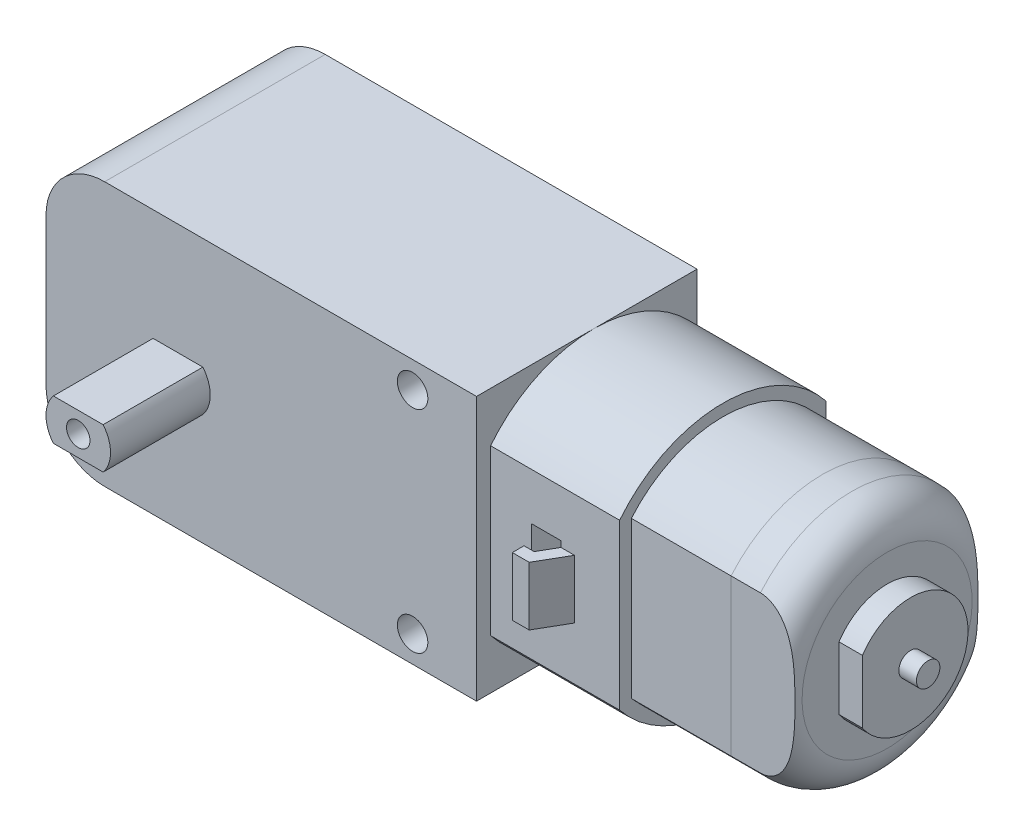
ISO-10303-21;
HEADER;
FILE_DESCRIPTION(('STEP AP214'),'2;1');
FILE_NAME('part.step','',(''),(''),'','','');
FILE_SCHEMA(('AUTOMOTIVE_DESIGN { 1 0 10303 214 1 1 1 1 }'));
ENDSEC;
DATA;
#1=APPLICATION_CONTEXT('core data for automotive mechanical design processes');
#2=APPLICATION_PROTOCOL_DEFINITION('international standard','automotive_design',2000,#1);
#3=PRODUCT_CONTEXT('',#1,'mechanical');
#4=PRODUCT('Part','Part','',(#3));
#5=PRODUCT_RELATED_PRODUCT_CATEGORY('part','',(#4));
#6=PRODUCT_DEFINITION_FORMATION('','',#4);
#7=PRODUCT_DEFINITION_CONTEXT('part definition',#1,'design');
#8=PRODUCT_DEFINITION('design','',#6,#7);
#9=PRODUCT_DEFINITION_SHAPE('','',#8);
#10=(LENGTH_UNIT() NAMED_UNIT(*) SI_UNIT(.MILLI.,.METRE.));
#11=(NAMED_UNIT(*) PLANE_ANGLE_UNIT() SI_UNIT($,.RADIAN.));
#12=(NAMED_UNIT(*) SI_UNIT($,.STERADIAN.) SOLID_ANGLE_UNIT());
#13=UNCERTAINTY_MEASURE_WITH_UNIT(LENGTH_MEASURE(1.E-05),#10,'distance_accuracy_value','');
#14=(GEOMETRIC_REPRESENTATION_CONTEXT(3) GLOBAL_UNCERTAINTY_ASSIGNED_CONTEXT((#13)) GLOBAL_UNIT_ASSIGNED_CONTEXT((#10,
#11,#12)) REPRESENTATION_CONTEXT('',''));
#15=CARTESIAN_POINT('',(0.,0.,0.));
#16=DIRECTION('',(0.,0.,1.));
#17=DIRECTION('',(1.,0.,0.));
#18=AXIS2_PLACEMENT_3D('',#15,#16,#17);
#19=CARTESIAN_POINT('',(0.,1.75,18.5));
#20=DIRECTION('',(0.,-1.,0.));
#21=DIRECTION('',(1.,0.,0.));
#22=AXIS2_PLACEMENT_3D('',#19,#20,#21);
#23=PLANE('',#22);
#24=DIRECTION('',(-1.,0.,0.));
#25=VECTOR('',#24,1.);
#26=CARTESIAN_POINT('',(0.,1.75,10.));
#27=LINE('',#26,#25);
#28=CARTESIAN_POINT('',(2.12132034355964,1.75,10.));
#29=VERTEX_POINT('',#28);
#30=CARTESIAN_POINT('',(-2.12132034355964,1.75,10.));
#31=VERTEX_POINT('',#30);
#32=EDGE_CURVE('E110',#29,#31,#27,.T.);
#33=ORIENTED_EDGE('',*,*,#32,.T.);
#34=DIRECTION('',(0.,0.,-1.));
#35=VECTOR('',#34,1.);
#36=CARTESIAN_POINT('',(-2.12132034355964,1.75,18.5));
#37=LINE('',#36,#35);
#38=CARTESIAN_POINT('',(-2.12132034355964,1.75,18.5));
#39=VERTEX_POINT('',#38);
#40=EDGE_CURVE('E12',#39,#31,#37,.T.);
#41=ORIENTED_EDGE('',*,*,#40,.F.);
#42=DIRECTION('',(-1.,0.,0.));
#43=VECTOR('',#42,1.);
#44=CARTESIAN_POINT('',(0.,1.75,18.5));
#45=LINE('',#44,#43);
#46=CARTESIAN_POINT('',(2.12132034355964,1.75,18.5));
#47=VERTEX_POINT('',#46);
#48=EDGE_CURVE('E93',#47,#39,#45,.T.);
#49=ORIENTED_EDGE('',*,*,#48,.F.);
#50=DIRECTION('',(0.,0.,-1.));
#51=VECTOR('',#50,1.);
#52=CARTESIAN_POINT('',(2.12132034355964,1.75,18.5));
#53=LINE('',#52,#51);
#54=EDGE_CURVE('E104',#47,#29,#53,.T.);
#55=ORIENTED_EDGE('',*,*,#54,.T.);
#56=EDGE_LOOP('',(#33,#41,#49,#55));
#57=FACE_BOUND('',#56,.T.);
#58=ADVANCED_FACE('F45',(#57),#23,.F.);
#59=CARTESIAN_POINT('',(0.,0.,18.5));
#60=DIRECTION('',(0.,0.,-1.));
#61=DIRECTION('',(-1.,0.,0.));
#62=AXIS2_PLACEMENT_3D('',#59,#60,#61);
#63=CYLINDRICAL_SURFACE('',#62,2.75);
#64=CARTESIAN_POINT('',(0.,0.,10.));
#65=DIRECTION('',(0.,0.,1.));
#66=DIRECTION('',(1.,0.,0.));
#67=AXIS2_PLACEMENT_3D('',#64,#65,#66);
#68=CIRCLE('',#67,2.75);
#69=CARTESIAN_POINT('',(-2.12132034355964,-1.75,10.));
#70=VERTEX_POINT('',#69);
#71=EDGE_CURVE('E98',#31,#70,#68,.T.);
#72=ORIENTED_EDGE('',*,*,#71,.T.);
#73=DIRECTION('',(0.,0.,-1.));
#74=VECTOR('',#73,1.);
#75=CARTESIAN_POINT('',(-2.12132034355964,-1.75,18.5));
#76=LINE('',#75,#74);
#77=CARTESIAN_POINT('',(-2.12132034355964,-1.75,18.5));
#78=VERTEX_POINT('',#77);
#79=EDGE_CURVE('E54',#78,#70,#76,.T.);
#80=ORIENTED_EDGE('',*,*,#79,.F.);
#81=CARTESIAN_POINT('',(0.,0.,18.5));
#82=DIRECTION('',(0.,0.,1.));
#83=DIRECTION('',(1.,0.,0.));
#84=AXIS2_PLACEMENT_3D('',#81,#82,#83);
#85=CIRCLE('',#84,2.75);
#86=EDGE_CURVE('E88',#39,#78,#85,.T.);
#87=ORIENTED_EDGE('',*,*,#86,.F.);
#88=ORIENTED_EDGE('',*,*,#40,.T.);
#89=EDGE_LOOP('',(#72,#80,#87,#88));
#90=FACE_BOUND('',#89,.T.);
#91=ADVANCED_FACE('F97',(#90),#63,.T.);
#92=CARTESIAN_POINT('',(0.,-1.75,18.5));
#93=DIRECTION('',(0.,-1.,0.));
#94=DIRECTION('',(1.,0.,0.));
#95=AXIS2_PLACEMENT_3D('',#92,#93,#94);
#96=PLANE('',#95);
#97=DIRECTION('',(-1.,0.,0.));
#98=VECTOR('',#97,1.);
#99=CARTESIAN_POINT('',(0.,-1.75,10.));
#100=LINE('',#99,#98);
#101=CARTESIAN_POINT('',(2.12132034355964,-1.75,10.));
#102=VERTEX_POINT('',#101);
#103=EDGE_CURVE('E114',#102,#70,#100,.T.);
#104=ORIENTED_EDGE('',*,*,#103,.F.);
#105=DIRECTION('',(0.,0.,-1.));
#106=VECTOR('',#105,1.);
#107=CARTESIAN_POINT('',(2.12132034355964,-1.75,18.5));
#108=LINE('',#107,#106);
#109=CARTESIAN_POINT('',(2.12132034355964,-1.75,18.5));
#110=VERTEX_POINT('',#109);
#111=EDGE_CURVE('E78',#110,#102,#108,.T.);
#112=ORIENTED_EDGE('',*,*,#111,.F.);
#113=DIRECTION('',(-1.,0.,0.));
#114=VECTOR('',#113,1.);
#115=CARTESIAN_POINT('',(0.,-1.75,18.5));
#116=LINE('',#115,#114);
#117=EDGE_CURVE('E91',#110,#78,#116,.T.);
#118=ORIENTED_EDGE('',*,*,#117,.T.);
#119=ORIENTED_EDGE('',*,*,#79,.T.);
#120=EDGE_LOOP('',(#104,#112,#118,#119));
#121=FACE_BOUND('',#120,.T.);
#122=ADVANCED_FACE('F102',(#121),#96,.T.);
#123=CARTESIAN_POINT('',(0.,0.,18.5));
#124=DIRECTION('',(0.,0.,-1.));
#125=DIRECTION('',(-1.,0.,0.));
#126=AXIS2_PLACEMENT_3D('',#123,#124,#125);
#127=CYLINDRICAL_SURFACE('',#126,1.);
#128=CARTESIAN_POINT('',(0.,0.,18.5));
#129=DIRECTION('',(0.,0.,1.));
#130=DIRECTION('',(1.,0.,0.));
#131=AXIS2_PLACEMENT_3D('',#128,#129,#130);
#132=CIRCLE('',#131,1.);
#133=CARTESIAN_POINT('',(1.,0.,18.5));
#134=VERTEX_POINT('',#133);
#135=EDGE_CURVE('E121',#134,#134,#132,.T.);
#136=ORIENTED_EDGE('',*,*,#135,.T.);
#137=EDGE_LOOP('',(#136));
#138=FACE_BOUND('',#137,.T.);
#139=CARTESIAN_POINT('',(0.,0.,10.));
#140=DIRECTION('',(0.,0.,1.));
#141=DIRECTION('',(1.,0.,0.));
#142=AXIS2_PLACEMENT_3D('',#139,#140,#141);
#143=CIRCLE('',#142,1.);
#144=CARTESIAN_POINT('',(1.,0.,10.));
#145=VERTEX_POINT('',#144);
#146=EDGE_CURVE('E107',#145,#145,#143,.T.);
#147=ORIENTED_EDGE('',*,*,#146,.F.);
#148=EDGE_LOOP('',(#147));
#149=FACE_BOUND('',#148,.T.);
#150=ADVANCED_FACE('F47',(#138,#149),#127,.F.);
#151=EDGE_CURVE('E81',#102,#29,#68,.T.);
#152=ORIENTED_EDGE('',*,*,#151,.T.);
#153=ORIENTED_EDGE('',*,*,#54,.F.);
#154=EDGE_CURVE('E62',#110,#47,#85,.T.);
#155=ORIENTED_EDGE('',*,*,#154,.F.);
#156=ORIENTED_EDGE('',*,*,#111,.T.);
#157=EDGE_LOOP('',(#152,#153,#155,#156));
#158=FACE_BOUND('',#157,.T.);
#159=ADVANCED_FACE('F129',(#158),#63,.T.);
#160=CARTESIAN_POINT('',(0.,0.,18.5));
#161=DIRECTION('',(0.,0.,1.));
#162=DIRECTION('',(1.,0.,0.));
#163=AXIS2_PLACEMENT_3D('',#160,#161,#162);
#164=PLANE('',#163);
#165=ORIENTED_EDGE('',*,*,#135,.F.);
#166=EDGE_LOOP('',(#165));
#167=FACE_BOUND('',#166,.T.);
#168=ORIENTED_EDGE('',*,*,#48,.T.);
#169=ORIENTED_EDGE('',*,*,#86,.T.);
#170=ORIENTED_EDGE('',*,*,#117,.F.);
#171=ORIENTED_EDGE('',*,*,#154,.T.);
#172=EDGE_LOOP('',(#168,#169,#170,#171));
#173=FACE_BOUND('',#172,.T.);
#174=ADVANCED_FACE('F89',(#167,#173),#164,.T.);
#175=CARTESIAN_POINT('',(0.,0.,10.));
#176=DIRECTION('',(0.,0.,1.));
#177=DIRECTION('',(1.,0.,0.));
#178=AXIS2_PLACEMENT_3D('',#175,#176,#177);
#179=PLANE('',#178);
#180=ORIENTED_EDGE('',*,*,#146,.T.);
#181=EDGE_LOOP('',(#180));
#182=FACE_BOUND('',#181,.T.);
#183=ORIENTED_EDGE('',*,*,#32,.F.);
#184=ORIENTED_EDGE('',*,*,#151,.F.);
#185=ORIENTED_EDGE('',*,*,#103,.T.);
#186=ORIENTED_EDGE('',*,*,#71,.F.);
#187=EDGE_LOOP('',(#183,#184,#185,#186));
#188=FACE_BOUND('',#187,.T.);
#189=ADVANCED_FACE('F120',(#182,#188),#179,.F.);
#190=CLOSED_SHELL('',(#58,#91,#122,#150,#159,#174,#189));
#191=MANIFOLD_SOLID_BREP('B2',#190);
#192=CARTESIAN_POINT('',(53.95,0.,0.));
#193=DIRECTION('',(-1.,0.,0.));
#194=DIRECTION('',(0.,0.,1.));
#195=AXIS2_PLACEMENT_3D('',#192,#193,#194);
#196=CYLINDRICAL_SURFACE('',#195,1.);
#197=CARTESIAN_POINT('',(53.95,0.,0.));
#198=DIRECTION('',(1.,0.,0.));
#199=DIRECTION('',(0.,0.,-1.));
#200=AXIS2_PLACEMENT_3D('',#197,#198,#199);
#201=CIRCLE('',#200,1.);
#202=CARTESIAN_POINT('',(53.95,0.,-1.));
#203=VERTEX_POINT('',#202);
#204=EDGE_CURVE('E44',#203,#203,#201,.T.);
#205=ORIENTED_EDGE('',*,*,#204,.F.);
#206=EDGE_LOOP('',(#205));
#207=FACE_BOUND('',#206,.T.);
#208=CARTESIAN_POINT('',(52.45,0.,0.));
#209=DIRECTION('',(1.,0.,0.));
#210=DIRECTION('',(0.,0.,-1.));
#211=AXIS2_PLACEMENT_3D('',#208,#209,#210);
#212=CIRCLE('',#211,1.);
#213=CARTESIAN_POINT('',(52.45,0.,-1.));
#214=VERTEX_POINT('',#213);
#215=EDGE_CURVE('E199',#214,#214,#212,.T.);
#216=ORIENTED_EDGE('',*,*,#215,.T.);
#217=EDGE_LOOP('',(#216));
#218=FACE_BOUND('',#217,.T.);
#219=ADVANCED_FACE('F196',(#207,#218),#196,.T.);
#220=CARTESIAN_POINT('',(53.95,0.,0.));
#221=DIRECTION('',(1.,0.,0.));
#222=DIRECTION('',(0.,0.,-1.));
#223=AXIS2_PLACEMENT_3D('',#220,#221,#222);
#224=PLANE('',#223);
#225=ORIENTED_EDGE('',*,*,#204,.T.);
#226=EDGE_LOOP('',(#225));
#227=FACE_BOUND('',#226,.T.);
#228=ADVANCED_FACE('F211',(#227),#224,.T.);
#229=CARTESIAN_POINT('',(52.45,0.,0.));
#230=DIRECTION('',(1.,0.,0.));
#231=DIRECTION('',(0.,0.,-1.));
#232=AXIS2_PLACEMENT_3D('',#229,#230,#231);
#233=PLANE('',#232);
#234=ORIENTED_EDGE('',*,*,#215,.F.);
#235=EDGE_LOOP('',(#234));
#236=FACE_BOUND('',#235,.T.);
#237=ADVANCED_FACE('F209',(#236),#233,.F.);
#238=CLOSED_SHELL('',(#219,#228,#237));
#239=MANIFOLD_SOLID_BREP('B6',#238);
#240=CARTESIAN_POINT('',(50.45,0.,0.));
#241=DIRECTION('',(1.,0.,0.));
#242=DIRECTION('',(0.,1.,0.));
#243=AXIS2_PLACEMENT_3D('',#240,#241,#242);
#244=PLANE('',#243);
#245=CARTESIAN_POINT('',(50.45,0.,0.));
#246=DIRECTION('',(1.,0.,0.));
#247=DIRECTION('',(0.,1.,0.));
#248=AXIS2_PLACEMENT_3D('',#245,#246,#247);
#249=CIRCLE('',#248,7.25000000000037);
#250=CARTESIAN_POINT('',(50.45,4.70365853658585,-5.51707317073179));
#251=VERTEX_POINT('',#250);
#252=EDGE_CURVE('E265',#251,#251,#249,.T.);
#253=ORIENTED_EDGE('',*,*,#252,.T.);
#254=EDGE_LOOP('',(#253));
#255=FACE_BOUND('',#254,.T.);
#256=CARTESIAN_POINT('',(50.45,0.,0.));
#257=DIRECTION('',(1.,0.,0.));
#258=DIRECTION('',(0.,0.,-1.));
#259=AXIS2_PLACEMENT_3D('',#256,#257,#258);
#260=CIRCLE('',#259,4.9);
#261=CARTESIAN_POINT('',(50.45,-2.68328157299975,4.1));
#262=VERTEX_POINT('',#261);
#263=CARTESIAN_POINT('',(50.45,2.68328157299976,4.1));
#264=VERTEX_POINT('',#263);
#265=EDGE_CURVE('E320',#262,#264,#260,.T.);
#266=ORIENTED_EDGE('',*,*,#265,.F.);
#267=DIRECTION('',(0.,-1.,0.));
#268=VECTOR('',#267,1.);
#269=CARTESIAN_POINT('',(50.45,0.,4.1));
#270=LINE('',#269,#268);
#271=EDGE_CURVE('E324',#264,#262,#270,.T.);
#272=ORIENTED_EDGE('',*,*,#271,.F.);
#273=EDGE_LOOP('',(#266,#272));
#274=FACE_BOUND('',#273,.T.);
#275=ADVANCED_FACE('F246',(#255,#274),#244,.T.);
#276=CARTESIAN_POINT('',(50.45,0.,0.));
#277=DIRECTION('',(-1.,0.,0.));
#278=DIRECTION('',(0.,-1.,0.));
#279=AXIS2_PLACEMENT_3D('',#276,#277,#278);
#280=CYLINDRICAL_SURFACE('',#279,10.2500000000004);
#281=DIRECTION('',(-1.,0.,0.));
#282=VECTOR('',#281,1.);
#283=CARTESIAN_POINT('',(50.45,-6.65000000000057,-7.8));
#284=LINE('',#283,#282);
#285=CARTESIAN_POINT('',(47.45,-6.65000000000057,-7.8));
#286=VERTEX_POINT('',#285);
#287=CARTESIAN_POINT('',(44.95,-6.65000000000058,-7.8));
#288=VERTEX_POINT('',#287);
#289=EDGE_CURVE('E347',#286,#288,#284,.T.);
#290=ORIENTED_EDGE('',*,*,#289,.F.);
#291=CARTESIAN_POINT('',(47.45,0.,0.));
#292=DIRECTION('',(-1.,0.,0.));
#293=DIRECTION('',(0.,-1.,0.));
#294=AXIS2_PLACEMENT_3D('',#291,#292,#293);
#295=CIRCLE('',#294,10.2500000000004);
#296=CARTESIAN_POINT('',(47.45,-6.65000000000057,7.8));
#297=VERTEX_POINT('',#296);
#298=EDGE_CURVE('E260',#286,#297,#295,.T.);
#299=ORIENTED_EDGE('',*,*,#298,.T.);
#300=DIRECTION('',(-1.,0.,0.));
#301=VECTOR('',#300,1.);
#302=CARTESIAN_POINT('',(50.45,-6.65000000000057,7.8));
#303=LINE('',#302,#301);
#304=CARTESIAN_POINT('',(44.95,-6.65000000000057,7.8));
#305=VERTEX_POINT('',#304);
#306=EDGE_CURVE('E341',#297,#305,#303,.T.);
#307=ORIENTED_EDGE('',*,*,#306,.T.);
#308=CARTESIAN_POINT('',(44.95,0.,0.));
#309=DIRECTION('',(1.,0.,0.));
#310=DIRECTION('',(0.,1.,0.));
#311=AXIS2_PLACEMENT_3D('',#308,#309,#310);
#312=CIRCLE('',#311,10.2500000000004);
#313=EDGE_CURVE('E325',#305,#288,#312,.T.);
#314=ORIENTED_EDGE('',*,*,#313,.T.);
#315=EDGE_LOOP('',(#290,#299,#307,#314));
#316=FACE_BOUND('',#315,.T.);
#317=ADVANCED_FACE('F364',(#316),#280,.T.);
#318=CARTESIAN_POINT('',(50.45,-6.65000000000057,-7.8));
#319=DIRECTION('',(0.,0.,1.));
#320=DIRECTION('',(0.,-1.,0.));
#321=AXIS2_PLACEMENT_3D('',#318,#319,#320);
#322=PLANE('',#321);
#323=DIRECTION('',(-1.,0.,0.));
#324=VECTOR('',#323,1.);
#325=CARTESIAN_POINT('',(50.45,6.65000000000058,-7.8));
#326=LINE('',#325,#324);
#327=CARTESIAN_POINT('',(47.45,6.65000000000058,-7.8));
#328=VERTEX_POINT('',#327);
#329=CARTESIAN_POINT('',(44.95,6.65000000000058,-7.8));
#330=VERTEX_POINT('',#329);
#331=EDGE_CURVE('E345',#328,#330,#326,.T.);
#332=ORIENTED_EDGE('',*,*,#331,.F.);
#333=CARTESIAN_POINT('',(47.45,6.65000000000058,-7.8));
#334=CARTESIAN_POINT('',(47.5119412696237,6.65001981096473,-7.8));
#335=CARTESIAN_POINT('',(47.5738720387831,6.64704380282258,-7.8));
#336=CARTESIAN_POINT('',(47.6971338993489,6.63525242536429,-7.8));
#337=CARTESIAN_POINT('',(47.7584653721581,6.62644105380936,-7.8));
#338=CARTESIAN_POINT('',(47.8795184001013,6.60323013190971,-7.8));
#339=CARTESIAN_POINT('',(47.9392492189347,6.58887882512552,-7.8));
#340=CARTESIAN_POINT('',(48.0571668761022,6.55486730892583,-7.8));
#341=CARTESIAN_POINT('',(48.1153535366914,6.53520649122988,-7.8));
#342=CARTESIAN_POINT('',(48.2867000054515,6.46884573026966,-7.8));
#343=CARTESIAN_POINT('',(48.3970487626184,6.41468731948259,-7.8));
#344=CARTESIAN_POINT('',(48.6079199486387,6.28962869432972,-7.8));
#345=CARTESIAN_POINT('',(48.7084183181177,6.21868886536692,-7.8));
#346=CARTESIAN_POINT('',(48.9333466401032,6.03486398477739,-7.8));
#347=CARTESIAN_POINT('',(49.0530033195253,5.91614395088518,-7.8));
#348=CARTESIAN_POINT('',(49.2716215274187,5.66120396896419,-7.8));
#349=CARTESIAN_POINT('',(49.3705634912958,5.52496767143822,-7.8));
#350=CARTESIAN_POINT('',(49.5285667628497,5.27390058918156,-7.8));
#351=CARTESIAN_POINT('',(49.5915486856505,5.16147924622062,-7.8));
#352=CARTESIAN_POINT('',(49.7074313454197,4.93149477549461,-7.8));
#353=CARTESIAN_POINT('',(49.7603252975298,4.81392825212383,-7.8));
#354=CARTESIAN_POINT('',(49.8572215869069,4.57484717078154,-7.8));
#355=CARTESIAN_POINT('',(49.9011986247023,4.45332248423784,-7.8));
#356=CARTESIAN_POINT('',(49.9811633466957,4.20779129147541,-7.8));
#357=CARTESIAN_POINT('',(50.0171560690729,4.08378640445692,-7.8));
#358=CARTESIAN_POINT('',(50.1101098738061,3.72720096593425,-7.8));
#359=CARTESIAN_POINT('',(50.1586875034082,3.49243843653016,-7.8));
#360=CARTESIAN_POINT('',(50.2383296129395,3.01989094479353,-7.8));
#361=CARTESIAN_POINT('',(50.269373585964,2.78210277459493,-7.8));
#362=CARTESIAN_POINT('',(50.3190864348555,2.30422292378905,-7.8));
#363=CARTESIAN_POINT('',(50.3376992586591,2.06412569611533,-7.8));
#364=CARTESIAN_POINT('',(50.3663685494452,1.58356617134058,-7.8));
#365=CARTESIAN_POINT('',(50.3764285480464,1.34310406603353,-7.8));
#366=CARTESIAN_POINT('',(50.3909161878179,0.859281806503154,-7.8));
#367=CARTESIAN_POINT('',(50.3952783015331,0.615919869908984,-7.8));
#368=CARTESIAN_POINT('',(50.399682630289,0.129131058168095,-7.8));
#369=CARTESIAN_POINT('',(50.3997243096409,-0.114295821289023,-7.8));
#370=CARTESIAN_POINT('',(50.3955046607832,-0.600491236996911,-7.8));
#371=CARTESIAN_POINT('',(50.3912543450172,-0.843259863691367,-7.8));
#372=CARTESIAN_POINT('',(50.3769945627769,-1.3286166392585,-7.8));
#373=CARTESIAN_POINT('',(50.3669859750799,-1.57120481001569,-7.8));
#374=CARTESIAN_POINT('',(50.3455564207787,-1.93335082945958,-7.8));
#375=CARTESIAN_POINT('',(50.3374081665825,-2.05309855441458,-7.8));
#376=CARTESIAN_POINT('',(50.3185117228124,-2.29238740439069,-7.8));
#377=CARTESIAN_POINT('',(50.3077635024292,-2.41192852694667,-7.8));
#378=CARTESIAN_POINT('',(50.2708192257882,-2.77032273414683,-7.8));
#379=CARTESIAN_POINT('',(50.2399340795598,-3.00873852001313,-7.8));
#380=CARTESIAN_POINT('',(50.1610812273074,-3.4797769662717,-7.8));
#381=CARTESIAN_POINT('',(50.1133318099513,-3.71243478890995,-7.8));
#382=CARTESIAN_POINT('',(49.9948253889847,-4.1716821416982,-7.8));
#383=CARTESIAN_POINT('',(49.9241119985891,-4.39828230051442,-7.8));
#384=CARTESIAN_POINT('',(49.7801007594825,-4.77015596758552,-7.8));
#385=CARTESIAN_POINT('',(49.7147101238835,-4.91846281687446,-7.8));
#386=CARTESIAN_POINT('',(49.5676179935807,-5.20738769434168,-7.8));
#387=CARTESIAN_POINT('',(49.4858760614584,-5.34798553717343,-7.8));
#388=CARTESIAN_POINT('',(49.3034404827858,-5.61815085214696,-7.8));
#389=CARTESIAN_POINT('',(49.2026005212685,-5.74762113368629,-7.8));
#390=CARTESIAN_POINT('',(48.9811690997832,-5.98840826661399,-7.8));
#391=CARTESIAN_POINT('',(48.8606185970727,-6.09976182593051,-7.8));
#392=CARTESIAN_POINT('',(48.6320346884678,-6.27318830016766,-7.8));
#393=CARTESIAN_POINT('',(48.5281022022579,-6.34065852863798,-7.8));
#394=CARTESIAN_POINT('',(48.3106115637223,-6.45769072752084,-7.8));
#395=CARTESIAN_POINT('',(48.1970709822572,-6.50728455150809,-7.8));
#396=CARTESIAN_POINT('',(48.0214309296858,-6.56599845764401,-7.8));
#397=CARTESIAN_POINT('',(47.9618738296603,-6.58297477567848,-7.8));
#398=CARTESIAN_POINT('',(47.8414343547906,-6.61137307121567,-7.8));
#399=CARTESIAN_POINT('',(47.7805520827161,-6.62279547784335,-7.8));
#400=CARTESIAN_POINT('',(47.6574918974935,-6.63991514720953,-7.8));
#401=CARTESIAN_POINT('',(47.5953075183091,-6.64556592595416,-7.8));
#402=CARTESIAN_POINT('',(47.4706481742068,-6.65089555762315,-7.8));
#403=CARTESIAN_POINT('',(47.4081730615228,-6.65057094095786,-7.8));
#404=CARTESIAN_POINT('',(47.345853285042,-6.64721243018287,-7.8));
#405=B_SPLINE_CURVE_WITH_KNOTS('',3,(#333,#334,#335,#336,#337,#338,#339,#340,#341,#342,#343,
#344,#345,#346,#347,#348,#349,#350,#351,#352,#353,#354,#355,#356,#357,#358,#359,#360,#361,#362,
#363,#364,#365,#366,#367,#368,#369,#370,#371,#372,#373,#374,#375,#376,#377,#378,#379,#380,#381,
#382,#383,#384,#385,#386,#387,#388,#389,#390,#391,#392,#393,#394,#395,#396,#397,#398,#399,#400,
#401,#402,#403,#404),.UNSPECIFIED.,.F.,.F.,(4,2,2,2,2,2,2,2,2,2,2,2,2,2,2,2,2,2,2,2,2,2,2,2,2,2,
2,2,2,2,2,2,2,2,2,4),(0.,0.185735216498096,0.371343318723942,0.555370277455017,
0.739418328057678,1.10630045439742,1.4740574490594,1.97692975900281,2.48027489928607,
2.86633112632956,3.25264609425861,3.64004225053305,4.02719325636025,4.74535666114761,
5.46435828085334,6.18658037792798,6.90850411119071,7.63865915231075,8.36890472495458,
9.09728137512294,9.82554689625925,10.185594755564,10.5456468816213,11.2663757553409,
11.9780983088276,12.6884769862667,13.1739351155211,13.6606089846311,14.1511743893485,
14.6407330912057,15.0110723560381,15.3807484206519,15.5663166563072,15.7518705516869,
15.938907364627,16.1260527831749),.UNSPECIFIED.);
#406=EDGE_CURVE('E353',#328,#286,#405,.T.);
#407=ORIENTED_EDGE('',*,*,#406,.T.);
#408=ORIENTED_EDGE('',*,*,#289,.T.);
#409=DIRECTION('',(0.,1.,0.));
#410=VECTOR('',#409,1.);
#411=CARTESIAN_POINT('',(44.95,-6.65000000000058,-7.8));
#412=LINE('',#411,#410);
#413=EDGE_CURVE('E328',#288,#330,#412,.T.);
#414=ORIENTED_EDGE('',*,*,#413,.T.);
#415=EDGE_LOOP('',(#332,#407,#408,#414));
#416=FACE_BOUND('',#415,.T.);
#417=ADVANCED_FACE('F359',(#416),#322,.F.);
#418=CARTESIAN_POINT('',(50.45,0.,0.));
#419=DIRECTION('',(-1.,0.,0.));
#420=DIRECTION('',(0.,-1.,0.));
#421=AXIS2_PLACEMENT_3D('',#418,#419,#420);
#422=CYLINDRICAL_SURFACE('',#421,10.2500000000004);
#423=DIRECTION('',(-1.,0.,0.));
#424=VECTOR('',#423,1.);
#425=CARTESIAN_POINT('',(50.45,6.65000000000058,7.8));
#426=LINE('',#425,#424);
#427=CARTESIAN_POINT('',(47.4500000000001,6.65000000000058,7.8));
#428=VERTEX_POINT('',#427);
#429=CARTESIAN_POINT('',(44.95,6.65000000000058,7.8));
#430=VERTEX_POINT('',#429);
#431=EDGE_CURVE('E343',#428,#430,#426,.T.);
#432=ORIENTED_EDGE('',*,*,#431,.F.);
#433=CARTESIAN_POINT('',(47.45,0.,0.));
#434=DIRECTION('',(1.,0.,0.));
#435=DIRECTION('',(0.,1.,0.));
#436=AXIS2_PLACEMENT_3D('',#433,#434,#435);
#437=CIRCLE('',#436,10.2500000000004);
#438=EDGE_CURVE('E350',#428,#328,#437,.F.);
#439=ORIENTED_EDGE('',*,*,#438,.T.);
#440=ORIENTED_EDGE('',*,*,#331,.T.);
#441=CARTESIAN_POINT('',(44.95,0.,0.));
#442=DIRECTION('',(1.,0.,0.));
#443=DIRECTION('',(0.,1.,0.));
#444=AXIS2_PLACEMENT_3D('',#441,#442,#443);
#445=CIRCLE('',#444,10.2500000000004);
#446=EDGE_CURVE('E335',#330,#430,#445,.T.);
#447=ORIENTED_EDGE('',*,*,#446,.T.);
#448=EDGE_LOOP('',(#432,#439,#440,#447));
#449=FACE_BOUND('',#448,.T.);
#450=ADVANCED_FACE('F363',(#449),#422,.T.);
#451=CARTESIAN_POINT('',(50.45,6.65000000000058,7.8));
#452=DIRECTION('',(0.,0.,-1.));
#453=DIRECTION('',(0.,1.,0.));
#454=AXIS2_PLACEMENT_3D('',#451,#452,#453);
#455=PLANE('',#454);
#456=ORIENTED_EDGE('',*,*,#306,.F.);
#457=CARTESIAN_POINT('',(47.45,-6.65000000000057,7.8));
#458=CARTESIAN_POINT('',(47.5119412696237,-6.65001981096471,7.8));
#459=CARTESIAN_POINT('',(47.5738720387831,-6.64704380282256,7.8));
#460=CARTESIAN_POINT('',(47.6971338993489,-6.63525242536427,7.8));
#461=CARTESIAN_POINT('',(47.7584653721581,-6.62644105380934,7.8));
#462=CARTESIAN_POINT('',(47.8795184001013,-6.60323013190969,7.8));
#463=CARTESIAN_POINT('',(47.9392492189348,-6.58887882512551,7.8));
#464=CARTESIAN_POINT('',(48.0571668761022,-6.55486730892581,7.8));
#465=CARTESIAN_POINT('',(48.1153535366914,-6.53520649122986,7.8));
#466=CARTESIAN_POINT('',(48.2867000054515,-6.46884573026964,7.8));
#467=CARTESIAN_POINT('',(48.3970487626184,-6.41468731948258,7.8));
#468=CARTESIAN_POINT('',(48.6079199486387,-6.28962869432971,7.8));
#469=CARTESIAN_POINT('',(48.7084183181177,-6.21868886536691,7.8));
#470=CARTESIAN_POINT('',(48.9333466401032,-6.03486398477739,7.8));
#471=CARTESIAN_POINT('',(49.0530033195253,-5.91614395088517,7.8));
#472=CARTESIAN_POINT('',(49.2716215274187,-5.66120396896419,7.8));
#473=CARTESIAN_POINT('',(49.3705634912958,-5.52496767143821,7.8));
#474=CARTESIAN_POINT('',(49.5285667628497,-5.27390058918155,7.8));
#475=CARTESIAN_POINT('',(49.5915486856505,-5.16147924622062,7.8));
#476=CARTESIAN_POINT('',(49.7074313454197,-4.93149477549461,7.8));
#477=CARTESIAN_POINT('',(49.7603252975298,-4.81392825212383,7.8));
#478=CARTESIAN_POINT('',(49.8572215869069,-4.57484717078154,7.8));
#479=CARTESIAN_POINT('',(49.9011986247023,-4.45332248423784,7.8));
#480=CARTESIAN_POINT('',(49.9811633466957,-4.20779129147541,7.8));
#481=CARTESIAN_POINT('',(50.0171560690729,-4.08378640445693,7.8));
#482=CARTESIAN_POINT('',(50.1101098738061,-3.72720096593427,7.8));
#483=CARTESIAN_POINT('',(50.1586875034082,-3.49243843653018,7.8));
#484=CARTESIAN_POINT('',(50.2383296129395,-3.01989094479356,7.8));
#485=CARTESIAN_POINT('',(50.269373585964,-2.78210277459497,7.8));
#486=CARTESIAN_POINT('',(50.3190864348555,-2.3042229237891,7.8));
#487=CARTESIAN_POINT('',(50.3376992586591,-2.06412569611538,7.8));
#488=CARTESIAN_POINT('',(50.3663685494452,-1.58356617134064,7.8));
#489=CARTESIAN_POINT('',(50.3764285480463,-1.3431040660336,7.8));
#490=CARTESIAN_POINT('',(50.3909161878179,-0.859281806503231,7.8));
#491=CARTESIAN_POINT('',(50.3952783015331,-0.615919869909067,7.8));
#492=CARTESIAN_POINT('',(50.399682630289,-0.129131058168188,7.8));
#493=CARTESIAN_POINT('',(50.3997243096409,0.114295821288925,7.8));
#494=CARTESIAN_POINT('',(50.3955046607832,0.600491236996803,7.8));
#495=CARTESIAN_POINT('',(50.3912543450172,0.843259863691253,7.8));
#496=CARTESIAN_POINT('',(50.3769945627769,1.32861663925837,7.8));
#497=CARTESIAN_POINT('',(50.3669859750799,1.57120481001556,7.8));
#498=CARTESIAN_POINT('',(50.3455564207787,1.93335082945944,7.8));
#499=CARTESIAN_POINT('',(50.3374081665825,2.05309855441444,7.8));
#500=CARTESIAN_POINT('',(50.3185117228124,2.29238740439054,7.8));
#501=CARTESIAN_POINT('',(50.3077635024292,2.41192852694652,7.8));
#502=CARTESIAN_POINT('',(50.2708192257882,2.77032273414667,7.8));
#503=CARTESIAN_POINT('',(50.2399340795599,3.00873852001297,7.8));
#504=CARTESIAN_POINT('',(50.1610812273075,3.47977696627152,7.8));
#505=CARTESIAN_POINT('',(50.1133318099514,3.71243478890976,7.8));
#506=CARTESIAN_POINT('',(49.9948253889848,4.17168214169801,7.8));
#507=CARTESIAN_POINT('',(49.9241119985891,4.39828230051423,7.8));
#508=CARTESIAN_POINT('',(49.7801007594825,4.77015596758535,7.8));
#509=CARTESIAN_POINT('',(49.7147101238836,4.9184628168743,7.8));
#510=CARTESIAN_POINT('',(49.5676179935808,5.20738769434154,7.8));
#511=CARTESIAN_POINT('',(49.4858760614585,5.34798553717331,7.8));
#512=CARTESIAN_POINT('',(49.3034404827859,5.61815085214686,7.8));
#513=CARTESIAN_POINT('',(49.2026005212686,5.74762113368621,7.8));
#514=CARTESIAN_POINT('',(48.9811690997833,5.98840826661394,7.8));
#515=CARTESIAN_POINT('',(48.8606185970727,6.09976182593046,7.8));
#516=CARTESIAN_POINT('',(48.6320346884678,6.27318830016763,7.8));
#517=CARTESIAN_POINT('',(48.528102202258,6.34065852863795,7.8));
#518=CARTESIAN_POINT('',(48.3106115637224,6.45769072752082,7.8));
#519=CARTESIAN_POINT('',(48.1970709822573,6.50728455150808,7.8));
#520=CARTESIAN_POINT('',(48.0214309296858,6.56599845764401,7.8));
#521=CARTESIAN_POINT('',(47.9618738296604,6.58297477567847,7.8));
#522=CARTESIAN_POINT('',(47.8414343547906,6.61137307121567,7.8));
#523=CARTESIAN_POINT('',(47.7805520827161,6.62279547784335,7.8));
#524=CARTESIAN_POINT('',(47.6574918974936,6.63991514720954,7.8));
#525=CARTESIAN_POINT('',(47.5953075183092,6.64556592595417,7.8));
#526=CARTESIAN_POINT('',(47.4706481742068,6.65089555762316,7.8));
#527=CARTESIAN_POINT('',(47.4081730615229,6.65057094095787,7.8));
#528=CARTESIAN_POINT('',(47.3458532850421,6.64721243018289,7.8));
#529=B_SPLINE_CURVE_WITH_KNOTS('',3,(#457,#458,#459,#460,#461,#462,#463,#464,#465,#466,#467,
#468,#469,#470,#471,#472,#473,#474,#475,#476,#477,#478,#479,#480,#481,#482,#483,#484,#485,#486,
#487,#488,#489,#490,#491,#492,#493,#494,#495,#496,#497,#498,#499,#500,#501,#502,#503,#504,#505,
#506,#507,#508,#509,#510,#511,#512,#513,#514,#515,#516,#517,#518,#519,#520,#521,#522,#523,#524,
#525,#526,#527,#528),.UNSPECIFIED.,.F.,.F.,(4,2,2,2,2,2,2,2,2,2,2,2,2,2,2,2,2,2,2,2,2,2,2,2,2,2,
2,2,2,2,2,2,2,2,2,4),(0.,0.185735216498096,0.371343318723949,0.555370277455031,
0.739418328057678,1.10630045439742,1.4740574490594,1.9769297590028,2.48027489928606,
2.86633112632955,3.2526460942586,3.64004225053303,4.02719325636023,4.74535666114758,
5.46435828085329,6.18658037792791,6.90850411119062,7.63865915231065,8.36890472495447,
9.09728137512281,9.8255468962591,10.1855947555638,10.5456468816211,11.2663757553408,
11.9780983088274,12.6884769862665,13.1739351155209,13.6606089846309,14.1511743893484,
14.6407330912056,15.011072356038,15.3807484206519,15.5663166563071,15.7518705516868,
15.938907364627,16.1260527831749),.UNSPECIFIED.);
#530=EDGE_CURVE('E194',#297,#428,#529,.T.);
#531=ORIENTED_EDGE('',*,*,#530,.T.);
#532=ORIENTED_EDGE('',*,*,#431,.T.);
#533=DIRECTION('',(0.,-1.,0.));
#534=VECTOR('',#533,1.);
#535=CARTESIAN_POINT('',(44.95,6.65000000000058,7.8));
#536=LINE('',#535,#534);
#537=EDGE_CURVE('E338',#430,#305,#536,.T.);
#538=ORIENTED_EDGE('',*,*,#537,.T.);
#539=EDGE_LOOP('',(#456,#531,#532,#538));
#540=FACE_BOUND('',#539,.T.);
#541=ADVANCED_FACE('F379',(#540),#455,.F.);
#542=CARTESIAN_POINT('',(44.95,0.,0.));
#543=DIRECTION('',(1.,0.,0.));
#544=DIRECTION('',(0.,1.,0.));
#545=AXIS2_PLACEMENT_3D('',#542,#543,#544);
#546=PLANE('',#545);
#547=ORIENTED_EDGE('',*,*,#313,.F.);
#548=ORIENTED_EDGE('',*,*,#537,.F.);
#549=ORIENTED_EDGE('',*,*,#446,.F.);
#550=ORIENTED_EDGE('',*,*,#413,.F.);
#551=EDGE_LOOP('',(#547,#548,#549,#550));
#552=FACE_BOUND('',#551,.T.);
#553=ADVANCED_FACE('F385',(#552),#546,.F.);
#554=CARTESIAN_POINT('',(52.45,0.,4.1));
#555=DIRECTION('',(0.,0.,-1.));
#556=DIRECTION('',(0.,1.,0.));
#557=AXIS2_PLACEMENT_3D('',#554,#555,#556);
#558=PLANE('',#557);
#559=ORIENTED_EDGE('',*,*,#271,.T.);
#560=DIRECTION('',(-1.,0.,0.));
#561=VECTOR('',#560,1.);
#562=CARTESIAN_POINT('',(52.45,-2.68328157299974,4.1));
#563=LINE('',#562,#561);
#564=CARTESIAN_POINT('',(52.45,-2.68328157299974,4.1));
#565=VERTEX_POINT('',#564);
#566=EDGE_CURVE('E310',#565,#262,#563,.T.);
#567=ORIENTED_EDGE('',*,*,#566,.F.);
#568=DIRECTION('',(0.,-1.,0.));
#569=VECTOR('',#568,1.);
#570=CARTESIAN_POINT('',(52.45,0.,4.1));
#571=LINE('',#570,#569);
#572=CARTESIAN_POINT('',(52.45,2.68328157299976,4.1));
#573=VERTEX_POINT('',#572);
#574=EDGE_CURVE('E316',#573,#565,#571,.T.);
#575=ORIENTED_EDGE('',*,*,#574,.F.);
#576=DIRECTION('',(-1.,0.,0.));
#577=VECTOR('',#576,1.);
#578=CARTESIAN_POINT('',(52.45,2.68328157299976,4.1));
#579=LINE('',#578,#577);
#580=EDGE_CURVE('E313',#573,#264,#579,.T.);
#581=ORIENTED_EDGE('',*,*,#580,.T.);
#582=EDGE_LOOP('',(#559,#567,#575,#581));
#583=FACE_BOUND('',#582,.T.);
#584=ADVANCED_FACE('F322',(#583),#558,.F.);
#585=CARTESIAN_POINT('',(52.45,0.,0.));
#586=DIRECTION('',(-1.,0.,0.));
#587=DIRECTION('',(0.,-1.,0.));
#588=AXIS2_PLACEMENT_3D('',#585,#586,#587);
#589=CYLINDRICAL_SURFACE('',#588,4.9);
#590=ORIENTED_EDGE('',*,*,#265,.T.);
#591=ORIENTED_EDGE('',*,*,#580,.F.);
#592=CARTESIAN_POINT('',(52.45,0.,0.));
#593=DIRECTION('',(1.,0.,0.));
#594=DIRECTION('',(0.,0.,-1.));
#595=AXIS2_PLACEMENT_3D('',#592,#593,#594);
#596=CIRCLE('',#595,4.9);
#597=EDGE_CURVE('E306',#565,#573,#596,.T.);
#598=ORIENTED_EDGE('',*,*,#597,.F.);
#599=ORIENTED_EDGE('',*,*,#566,.T.);
#600=EDGE_LOOP('',(#590,#591,#598,#599));
#601=FACE_BOUND('',#600,.T.);
#602=ADVANCED_FACE('F308',(#601),#589,.T.);
#603=CARTESIAN_POINT('',(52.45,0.,0.));
#604=DIRECTION('',(1.,0.,0.));
#605=DIRECTION('',(0.,0.,-1.));
#606=AXIS2_PLACEMENT_3D('',#603,#604,#605);
#607=PLANE('',#606);
#608=ORIENTED_EDGE('',*,*,#574,.T.);
#609=ORIENTED_EDGE('',*,*,#597,.T.);
#610=EDGE_LOOP('',(#608,#609));
#611=FACE_BOUND('',#610,.T.);
#612=ADVANCED_FACE('F318',(#611),#607,.T.);
#613=CARTESIAN_POINT('',(47.45,0.,0.));
#614=DIRECTION('',(1.,0.,0.));
#615=DIRECTION('',(0.,1.,0.));
#616=AXIS2_PLACEMENT_3D('',#613,#614,#615);
#617=TOROIDAL_SURFACE('',#616,7.25000000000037,3.);
#618=ORIENTED_EDGE('',*,*,#406,.F.);
#619=ORIENTED_EDGE('',*,*,#438,.F.);
#620=ORIENTED_EDGE('',*,*,#530,.F.);
#621=ORIENTED_EDGE('',*,*,#298,.F.);
#622=EDGE_LOOP('',(#618,#619,#620,#621));
#623=FACE_BOUND('',#622,.T.);
#624=ORIENTED_EDGE('',*,*,#252,.F.);
#625=EDGE_LOOP('',(#624));
#626=FACE_BOUND('',#625,.T.);
#627=ADVANCED_FACE('F248',(#623,#626),#617,.T.);
#628=CLOSED_SHELL('',(#275,#317,#417,#450,#541,#553,#584,#602,#612,#627));
#629=MANIFOLD_SOLID_BREP('B39',#628);
#630=CARTESIAN_POINT('',(44.95,0.,0.));
#631=DIRECTION('',(-1.,0.,0.));
#632=DIRECTION('',(0.,-1.,0.));
#633=AXIS2_PLACEMENT_3D('',#630,#631,#632);
#634=CYLINDRICAL_SURFACE('',#633,10.2500000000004);
#635=CARTESIAN_POINT('',(36.45,0.,0.));
#636=DIRECTION('',(1.,0.,0.));
#637=DIRECTION('',(0.,1.,0.));
#638=AXIS2_PLACEMENT_3D('',#635,#636,#637);
#639=CIRCLE('',#638,10.2500000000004);
#640=CARTESIAN_POINT('',(36.45,-6.65000000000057,7.8));
#641=VERTEX_POINT('',#640);
#642=CARTESIAN_POINT('',(36.45,-6.65000000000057,-7.8));
#643=VERTEX_POINT('',#642);
#644=EDGE_CURVE('E533',#641,#643,#639,.T.);
#645=ORIENTED_EDGE('',*,*,#644,.T.);
#646=DIRECTION('',(-1.,0.,0.));
#647=VECTOR('',#646,1.);
#648=CARTESIAN_POINT('',(44.95,-6.65000000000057,-7.8));
#649=LINE('',#648,#647);
#650=CARTESIAN_POINT('',(44.95,-6.65000000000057,-7.8));
#651=VERTEX_POINT('',#650);
#652=EDGE_CURVE('E244',#651,#643,#649,.T.);
#653=ORIENTED_EDGE('',*,*,#652,.F.);
#654=CARTESIAN_POINT('',(44.95,0.,0.));
#655=DIRECTION('',(1.,0.,0.));
#656=DIRECTION('',(0.,1.,0.));
#657=AXIS2_PLACEMENT_3D('',#654,#655,#656);
#658=CIRCLE('',#657,10.2500000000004);
#659=CARTESIAN_POINT('',(44.95,-6.65000000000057,7.8));
#660=VERTEX_POINT('',#659);
#661=EDGE_CURVE('E521',#660,#651,#658,.T.);
#662=ORIENTED_EDGE('',*,*,#661,.F.);
#663=DIRECTION('',(-1.,0.,0.));
#664=VECTOR('',#663,1.);
#665=CARTESIAN_POINT('',(44.95,-6.65000000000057,7.8));
#666=LINE('',#665,#664);
#667=EDGE_CURVE('E529',#660,#641,#666,.T.);
#668=ORIENTED_EDGE('',*,*,#667,.T.);
#669=EDGE_LOOP('',(#645,#653,#662,#668));
#670=FACE_BOUND('',#669,.T.);
#671=ADVANCED_FACE('F470',(#670),#634,.T.);
#672=CARTESIAN_POINT('',(44.95,-6.65000000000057,-7.8));
#673=DIRECTION('',(0.,0.,1.));
#674=DIRECTION('',(1.,0.,0.));
#675=AXIS2_PLACEMENT_3D('',#672,#673,#674);
#676=PLANE('',#675);
#677=DIRECTION('',(0.,1.,0.));
#678=VECTOR('',#677,1.);
#679=CARTESIAN_POINT('',(36.45,-6.65000000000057,-7.8));
#680=LINE('',#679,#678);
#681=CARTESIAN_POINT('',(36.45,6.65000000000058,-7.8));
#682=VERTEX_POINT('',#681);
#683=EDGE_CURVE('E525',#643,#682,#680,.T.);
#684=ORIENTED_EDGE('',*,*,#683,.T.);
#685=DIRECTION('',(-1.,0.,0.));
#686=VECTOR('',#685,1.);
#687=CARTESIAN_POINT('',(44.95,6.65000000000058,-7.8));
#688=LINE('',#687,#686);
#689=CARTESIAN_POINT('',(44.95,6.65000000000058,-7.8));
#690=VERTEX_POINT('',#689);
#691=EDGE_CURVE('E478',#690,#682,#688,.T.);
#692=ORIENTED_EDGE('',*,*,#691,.F.);
#693=DIRECTION('',(0.,1.,0.));
#694=VECTOR('',#693,1.);
#695=CARTESIAN_POINT('',(44.95,-6.65000000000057,-7.8));
#696=LINE('',#695,#694);
#697=EDGE_CURVE('E516',#651,#690,#696,.T.);
#698=ORIENTED_EDGE('',*,*,#697,.F.);
#699=ORIENTED_EDGE('',*,*,#652,.T.);
#700=EDGE_LOOP('',(#684,#692,#698,#699));
#701=FACE_BOUND('',#700,.T.);
#702=ADVANCED_FACE('F524',(#701),#676,.F.);
#703=CARTESIAN_POINT('',(44.95,0.,0.));
#704=DIRECTION('',(-1.,0.,0.));
#705=DIRECTION('',(0.,-1.,0.));
#706=AXIS2_PLACEMENT_3D('',#703,#704,#705);
#707=CYLINDRICAL_SURFACE('',#706,10.2500000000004);
#708=CARTESIAN_POINT('',(36.45,0.,0.));
#709=DIRECTION('',(1.,0.,0.));
#710=DIRECTION('',(0.,1.,0.));
#711=AXIS2_PLACEMENT_3D('',#708,#709,#710);
#712=CIRCLE('',#711,10.2500000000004);
#713=CARTESIAN_POINT('',(36.45,6.65000000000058,7.8));
#714=VERTEX_POINT('',#713);
#715=EDGE_CURVE('E503',#682,#714,#712,.T.);
#716=ORIENTED_EDGE('',*,*,#715,.T.);
#717=DIRECTION('',(-1.,0.,0.));
#718=VECTOR('',#717,1.);
#719=CARTESIAN_POINT('',(44.95,6.65000000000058,7.8));
#720=LINE('',#719,#718);
#721=CARTESIAN_POINT('',(44.95,6.65000000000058,7.8));
#722=VERTEX_POINT('',#721);
#723=EDGE_CURVE('E526',#722,#714,#720,.T.);
#724=ORIENTED_EDGE('',*,*,#723,.F.);
#725=CARTESIAN_POINT('',(44.95,0.,0.));
#726=DIRECTION('',(1.,0.,0.));
#727=DIRECTION('',(0.,1.,0.));
#728=AXIS2_PLACEMENT_3D('',#725,#726,#727);
#729=CIRCLE('',#728,10.2500000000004);
#730=EDGE_CURVE('E519',#690,#722,#729,.T.);
#731=ORIENTED_EDGE('',*,*,#730,.F.);
#732=ORIENTED_EDGE('',*,*,#691,.T.);
#733=EDGE_LOOP('',(#716,#724,#731,#732));
#734=FACE_BOUND('',#733,.T.);
#735=ADVANCED_FACE('F527',(#734),#707,.T.);
#736=CARTESIAN_POINT('',(44.95,6.65000000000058,7.8));
#737=DIRECTION('',(0.,0.,-1.));
#738=DIRECTION('',(-1.,0.,0.));
#739=AXIS2_PLACEMENT_3D('',#736,#737,#738);
#740=PLANE('',#739);
#741=DIRECTION('',(0.,-1.,0.));
#742=VECTOR('',#741,1.);
#743=CARTESIAN_POINT('',(36.45,6.65000000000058,7.8));
#744=LINE('',#743,#742);
#745=EDGE_CURVE('E509',#714,#641,#744,.T.);
#746=ORIENTED_EDGE('',*,*,#745,.T.);
#747=ORIENTED_EDGE('',*,*,#667,.F.);
#748=DIRECTION('',(0.,-1.,0.));
#749=VECTOR('',#748,1.);
#750=CARTESIAN_POINT('',(44.95,6.65000000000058,7.8));
#751=LINE('',#750,#749);
#752=EDGE_CURVE('E486',#722,#660,#751,.T.);
#753=ORIENTED_EDGE('',*,*,#752,.F.);
#754=ORIENTED_EDGE('',*,*,#723,.T.);
#755=EDGE_LOOP('',(#746,#747,#753,#754));
#756=FACE_BOUND('',#755,.T.);
#757=ADVANCED_FACE('F540',(#756),#740,.F.);
#758=CARTESIAN_POINT('',(44.95,0.,0.));
#759=DIRECTION('',(1.,0.,0.));
#760=DIRECTION('',(0.,1.,0.));
#761=AXIS2_PLACEMENT_3D('',#758,#759,#760);
#762=PLANE('',#761);
#763=ORIENTED_EDGE('',*,*,#661,.T.);
#764=ORIENTED_EDGE('',*,*,#697,.T.);
#765=ORIENTED_EDGE('',*,*,#730,.T.);
#766=ORIENTED_EDGE('',*,*,#752,.T.);
#767=EDGE_LOOP('',(#763,#764,#765,#766));
#768=FACE_BOUND('',#767,.T.);
#769=ADVANCED_FACE('F517',(#768),#762,.T.);
#770=CARTESIAN_POINT('',(36.45,0.,0.));
#771=DIRECTION('',(1.,0.,0.));
#772=DIRECTION('',(0.,1.,0.));
#773=AXIS2_PLACEMENT_3D('',#770,#771,#772);
#774=PLANE('',#773);
#775=ORIENTED_EDGE('',*,*,#644,.F.);
#776=ORIENTED_EDGE('',*,*,#745,.F.);
#777=ORIENTED_EDGE('',*,*,#715,.F.);
#778=ORIENTED_EDGE('',*,*,#683,.F.);
#779=EDGE_LOOP('',(#775,#776,#777,#778));
#780=FACE_BOUND('',#779,.T.);
#781=ADVANCED_FACE('F543',(#780),#774,.F.);
#782=CLOSED_SHELL('',(#671,#702,#735,#757,#769,#781));
#783=MANIFOLD_SOLID_BREP('B188',#782);
#784=CARTESIAN_POINT('',(25.45,11.25,-8.8));
#785=DIRECTION('',(1.,0.,0.));
#786=DIRECTION('',(0.,1.,0.));
#787=AXIS2_PLACEMENT_3D('',#784,#785,#786);
#788=PLANE('',#787);
#789=CARTESIAN_POINT('',(25.45,0.,0.));
#790=DIRECTION('',(1.,0.,0.));
#791=DIRECTION('',(0.,1.,0.));
#792=AXIS2_PLACEMENT_3D('',#789,#790,#791);
#793=CIRCLE('',#792,11.25);
#794=CARTESIAN_POINT('',(25.45,7.00874453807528,-8.8));
#795=VERTEX_POINT('',#794);
#796=CARTESIAN_POINT('',(25.45,11.25,0.));
#797=VERTEX_POINT('',#796);
#798=EDGE_CURVE('E942',#795,#797,#793,.T.);
#799=ORIENTED_EDGE('',*,*,#798,.F.);
#800=DIRECTION('',(0.,1.,0.));
#801=VECTOR('',#800,1.);
#802=CARTESIAN_POINT('',(25.45,11.25,-8.8));
#803=LINE('',#802,#801);
#804=CARTESIAN_POINT('',(25.45,11.25,-8.8));
#805=VERTEX_POINT('',#804);
#806=EDGE_CURVE('E958',#795,#805,#803,.T.);
#807=ORIENTED_EDGE('',*,*,#806,.T.);
#808=DIRECTION('',(0.,0.,1.));
#809=VECTOR('',#808,1.);
#810=CARTESIAN_POINT('',(25.45,11.25,-8.8));
#811=LINE('',#810,#809);
#812=EDGE_CURVE('E1045',#805,#797,#811,.T.);
#813=ORIENTED_EDGE('',*,*,#812,.T.);
#814=EDGE_LOOP('',(#799,#807,#813));
#815=FACE_BOUND('',#814,.T.);
#816=ADVANCED_FACE('F593',(#815),#788,.T.);
#817=CARTESIAN_POINT('',(25.45,7.00874453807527,8.8));
#818=VERTEX_POINT('',#817);
#819=EDGE_CURVE('E468',#797,#818,#793,.T.);
#820=ORIENTED_EDGE('',*,*,#819,.F.);
#821=CARTESIAN_POINT('',(25.45,11.25,10.));
#822=VERTEX_POINT('',#821);
#823=EDGE_CURVE('E1049',#797,#822,#811,.T.);
#824=ORIENTED_EDGE('',*,*,#823,.T.);
#825=DIRECTION('',(0.,1.,0.));
#826=VECTOR('',#825,1.);
#827=CARTESIAN_POINT('',(25.45,11.25,10.));
#828=LINE('',#827,#826);
#829=CARTESIAN_POINT('',(25.45,-11.25,10.));
#830=VERTEX_POINT('',#829);
#831=EDGE_CURVE('E1015',#830,#822,#828,.T.);
#832=ORIENTED_EDGE('',*,*,#831,.F.);
#833=DIRECTION('',(0.,0.,1.));
#834=VECTOR('',#833,1.);
#835=CARTESIAN_POINT('',(25.45,-11.25,-8.8));
#836=LINE('',#835,#834);
#837=CARTESIAN_POINT('',(25.45,-11.25,0.));
#838=VERTEX_POINT('',#837);
#839=EDGE_CURVE('E1057',#838,#830,#836,.T.);
#840=ORIENTED_EDGE('',*,*,#839,.F.);
#841=CARTESIAN_POINT('',(25.45,-7.00874453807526,8.8));
#842=VERTEX_POINT('',#841);
#843=EDGE_CURVE('E605',#842,#838,#793,.T.);
#844=ORIENTED_EDGE('',*,*,#843,.F.);
#845=DIRECTION('',(0.,1.,0.));
#846=VECTOR('',#845,1.);
#847=CARTESIAN_POINT('',(25.45,0.,8.8));
#848=LINE('',#847,#846);
#849=EDGE_CURVE('E934',#842,#818,#848,.T.);
#850=ORIENTED_EDGE('',*,*,#849,.T.);
#851=EDGE_LOOP('',(#820,#824,#832,#840,#844,#850));
#852=FACE_BOUND('',#851,.T.);
#853=ADVANCED_FACE('F1123',(#852),#788,.T.);
#854=CARTESIAN_POINT('',(-11.25,6.24999999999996,-8.8));
#855=DIRECTION('',(-1.,0.,0.));
#856=DIRECTION('',(0.,-1.,0.));
#857=AXIS2_PLACEMENT_3D('',#854,#855,#856);
#858=PLANE('',#857);
#859=DIRECTION('',(0.,0.,1.));
#860=VECTOR('',#859,1.);
#861=CARTESIAN_POINT('',(-11.25,-6.24999999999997,-8.8));
#862=LINE('',#861,#860);
#863=CARTESIAN_POINT('',(-11.25,-6.24999999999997,-8.8));
#864=VERTEX_POINT('',#863);
#865=CARTESIAN_POINT('',(-11.25,-6.24999999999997,10.));
#866=VERTEX_POINT('',#865);
#867=EDGE_CURVE('E1053',#864,#866,#862,.T.);
#868=ORIENTED_EDGE('',*,*,#867,.T.);
#869=DIRECTION('',(0.,-1.,0.));
#870=VECTOR('',#869,1.);
#871=CARTESIAN_POINT('',(-11.25,6.24999999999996,10.));
#872=LINE('',#871,#870);
#873=CARTESIAN_POINT('',(-11.25,6.24999999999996,10.));
#874=VERTEX_POINT('',#873);
#875=EDGE_CURVE('E1024',#874,#866,#872,.T.);
#876=ORIENTED_EDGE('',*,*,#875,.F.);
#877=DIRECTION('',(0.,0.,1.));
#878=VECTOR('',#877,1.);
#879=CARTESIAN_POINT('',(-11.25,6.24999999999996,-8.8));
#880=LINE('',#879,#878);
#881=CARTESIAN_POINT('',(-11.25,6.24999999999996,-8.8));
#882=VERTEX_POINT('',#881);
#883=EDGE_CURVE('E1051',#882,#874,#880,.T.);
#884=ORIENTED_EDGE('',*,*,#883,.F.);
#885=DIRECTION('',(0.,-1.,0.));
#886=VECTOR('',#885,1.);
#887=CARTESIAN_POINT('',(-11.25,6.24999999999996,-8.8));
#888=LINE('',#887,#886);
#889=EDGE_CURVE('E1066',#882,#864,#888,.T.);
#890=ORIENTED_EDGE('',*,*,#889,.T.);
#891=EDGE_LOOP('',(#868,#876,#884,#890));
#892=FACE_BOUND('',#891,.T.);
#893=DIRECTION('',(0.,1.,0.));
#894=VECTOR('',#893,1.);
#895=CARTESIAN_POINT('',(-11.25,2.5,-1.5));
#896=LINE('',#895,#894);
#897=CARTESIAN_POINT('',(-11.25,-2.5,-1.5));
#898=VERTEX_POINT('',#897);
#899=CARTESIAN_POINT('',(-11.25,2.5,-1.5));
#900=VERTEX_POINT('',#899);
#901=EDGE_CURVE('E977',#898,#900,#896,.T.);
#902=ORIENTED_EDGE('',*,*,#901,.T.);
#903=DIRECTION('',(0.,0.,-1.));
#904=VECTOR('',#903,1.);
#905=CARTESIAN_POINT('',(-11.25,2.5,1.5));
#906=LINE('',#905,#904);
#907=CARTESIAN_POINT('',(-11.25,2.5,1.5));
#908=VERTEX_POINT('',#907);
#909=EDGE_CURVE('E1006',#908,#900,#906,.T.);
#910=ORIENTED_EDGE('',*,*,#909,.F.);
#911=DIRECTION('',(0.,1.,0.));
#912=VECTOR('',#911,1.);
#913=CARTESIAN_POINT('',(-11.25,2.5,1.5));
#914=LINE('',#913,#912);
#915=CARTESIAN_POINT('',(-11.25,-2.5,1.5));
#916=VERTEX_POINT('',#915);
#917=EDGE_CURVE('E979',#916,#908,#914,.T.);
#918=ORIENTED_EDGE('',*,*,#917,.F.);
#919=DIRECTION('',(0.,0.,-1.));
#920=VECTOR('',#919,1.);
#921=CARTESIAN_POINT('',(-11.25,-2.5,1.5));
#922=LINE('',#921,#920);
#923=EDGE_CURVE('E989',#916,#898,#922,.T.);
#924=ORIENTED_EDGE('',*,*,#923,.T.);
#925=EDGE_LOOP('',(#902,#910,#918,#924));
#926=FACE_BOUND('',#925,.T.);
#927=ADVANCED_FACE('F1086',(#892,#926),#858,.T.);
#928=CARTESIAN_POINT('',(25.45,-7.00874453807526,-8.8));
#929=VERTEX_POINT('',#928);
#930=EDGE_CURVE('E603',#838,#929,#793,.T.);
#931=ORIENTED_EDGE('',*,*,#930,.F.);
#932=CARTESIAN_POINT('',(25.45,-11.25,-8.8));
#933=VERTEX_POINT('',#932);
#934=EDGE_CURVE('E957',#933,#838,#836,.T.);
#935=ORIENTED_EDGE('',*,*,#934,.F.);
#936=EDGE_CURVE('E1043',#933,#929,#803,.T.);
#937=ORIENTED_EDGE('',*,*,#936,.T.);
#938=EDGE_LOOP('',(#931,#935,#937));
#939=FACE_BOUND('',#938,.T.);
#940=ADVANCED_FACE('F595',(#939),#788,.T.);
#941=CARTESIAN_POINT('',(-6.24999999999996,-11.25,-8.8));
#942=DIRECTION('',(0.,-1.,0.));
#943=DIRECTION('',(1.,0.,0.));
#944=AXIS2_PLACEMENT_3D('',#941,#942,#943);
#945=PLANE('',#944);
#946=ORIENTED_EDGE('',*,*,#934,.T.);
#947=ORIENTED_EDGE('',*,*,#839,.T.);
#948=DIRECTION('',(1.,0.,0.));
#949=VECTOR('',#948,1.);
#950=CARTESIAN_POINT('',(-6.24999999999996,-11.25,10.));
#951=LINE('',#950,#949);
#952=CARTESIAN_POINT('',(-6.24999999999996,-11.25,10.));
#953=VERTEX_POINT('',#952);
#954=EDGE_CURVE('E1030',#953,#830,#951,.T.);
#955=ORIENTED_EDGE('',*,*,#954,.F.);
#956=DIRECTION('',(0.,0.,1.));
#957=VECTOR('',#956,1.);
#958=CARTESIAN_POINT('',(-6.24999999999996,-11.25,-8.8));
#959=LINE('',#958,#957);
#960=CARTESIAN_POINT('',(-6.24999999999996,-11.25,-8.8));
#961=VERTEX_POINT('',#960);
#962=EDGE_CURVE('E1055',#961,#953,#959,.T.);
#963=ORIENTED_EDGE('',*,*,#962,.F.);
#964=DIRECTION('',(1.,0.,0.));
#965=VECTOR('',#964,1.);
#966=CARTESIAN_POINT('',(-6.24999999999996,-11.25,-8.8));
#967=LINE('',#966,#965);
#968=EDGE_CURVE('E1060',#961,#933,#967,.T.);
#969=ORIENTED_EDGE('',*,*,#968,.T.);
#970=EDGE_LOOP('',(#946,#947,#955,#963,#969));
#971=FACE_BOUND('',#970,.T.);
#972=ADVANCED_FACE('F1128',(#971),#945,.T.);
#973=CARTESIAN_POINT('',(-6.25,-6.25,-8.8));
#974=DIRECTION('',(0.,0.,1.));
#975=DIRECTION('',(1.,0.,0.));
#976=AXIS2_PLACEMENT_3D('',#973,#974,#975);
#977=CYLINDRICAL_SURFACE('',#976,5.);
#978=ORIENTED_EDGE('',*,*,#962,.T.);
#979=CARTESIAN_POINT('',(-6.25,-6.25,10.));
#980=DIRECTION('',(0.,0.,1.));
#981=DIRECTION('',(1.,0.,0.));
#982=AXIS2_PLACEMENT_3D('',#979,#980,#981);
#983=CIRCLE('',#982,5.);
#984=EDGE_CURVE('E1027',#866,#953,#983,.T.);
#985=ORIENTED_EDGE('',*,*,#984,.F.);
#986=ORIENTED_EDGE('',*,*,#867,.F.);
#987=CARTESIAN_POINT('',(-6.25,-6.25,-8.8));
#988=DIRECTION('',(0.,0.,1.));
#989=DIRECTION('',(1.,0.,0.));
#990=AXIS2_PLACEMENT_3D('',#987,#988,#989);
#991=CIRCLE('',#990,5.);
#992=EDGE_CURVE('E1063',#864,#961,#991,.T.);
#993=ORIENTED_EDGE('',*,*,#992,.T.);
#994=EDGE_LOOP('',(#978,#985,#986,#993));
#995=FACE_BOUND('',#994,.T.);
#996=ADVANCED_FACE('F1134',(#995),#977,.T.);
#997=CARTESIAN_POINT('',(-6.25,6.25,-8.8));
#998=DIRECTION('',(0.,0.,1.));
#999=DIRECTION('',(1.,0.,0.));
#1000=AXIS2_PLACEMENT_3D('',#997,#998,#999);
#1001=CYLINDRICAL_SURFACE('',#1000,5.);
#1002=ORIENTED_EDGE('',*,*,#883,.T.);
#1003=CARTESIAN_POINT('',(-6.25,6.25,10.));
#1004=DIRECTION('',(0.,0.,1.));
#1005=DIRECTION('',(1.,0.,0.));
#1006=AXIS2_PLACEMENT_3D('',#1003,#1004,#1005);
#1007=CIRCLE('',#1006,5.);
#1008=CARTESIAN_POINT('',(-6.24999999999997,11.25,10.));
#1009=VERTEX_POINT('',#1008);
#1010=EDGE_CURVE('E1021',#1009,#874,#1007,.T.);
#1011=ORIENTED_EDGE('',*,*,#1010,.F.);
#1012=DIRECTION('',(0.,0.,1.));
#1013=VECTOR('',#1012,1.);
#1014=CARTESIAN_POINT('',(-6.24999999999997,11.25,-8.8));
#1015=LINE('',#1014,#1013);
#1016=CARTESIAN_POINT('',(-6.24999999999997,11.25,-8.8));
#1017=VERTEX_POINT('',#1016);
#1018=EDGE_CURVE('E1048',#1017,#1009,#1015,.T.);
#1019=ORIENTED_EDGE('',*,*,#1018,.F.);
#1020=CARTESIAN_POINT('',(-6.25,6.25,-8.8));
#1021=DIRECTION('',(0.,0.,1.));
#1022=DIRECTION('',(1.,0.,0.));
#1023=AXIS2_PLACEMENT_3D('',#1020,#1021,#1022);
#1024=CIRCLE('',#1023,5.);
#1025=EDGE_CURVE('E1068',#1017,#882,#1024,.T.);
#1026=ORIENTED_EDGE('',*,*,#1025,.T.);
#1027=EDGE_LOOP('',(#1002,#1011,#1019,#1026));
#1028=FACE_BOUND('',#1027,.T.);
#1029=ADVANCED_FACE('F1090',(#1028),#1001,.T.);
#1030=CARTESIAN_POINT('',(-6.24999999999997,11.25,-8.8));
#1031=DIRECTION('',(0.,1.,0.));
#1032=DIRECTION('',(-1.,0.,0.));
#1033=AXIS2_PLACEMENT_3D('',#1030,#1031,#1032);
#1034=PLANE('',#1033);
#1035=ORIENTED_EDGE('',*,*,#1018,.T.);
#1036=DIRECTION('',(-1.,0.,0.));
#1037=VECTOR('',#1036,1.);
#1038=CARTESIAN_POINT('',(-6.24999999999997,11.25,10.));
#1039=LINE('',#1038,#1037);
#1040=EDGE_CURVE('E1018',#822,#1009,#1039,.T.);
#1041=ORIENTED_EDGE('',*,*,#1040,.F.);
#1042=ORIENTED_EDGE('',*,*,#823,.F.);
#1043=ORIENTED_EDGE('',*,*,#812,.F.);
#1044=DIRECTION('',(-1.,0.,0.));
#1045=VECTOR('',#1044,1.);
#1046=CARTESIAN_POINT('',(-6.24999999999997,11.25,-8.8));
#1047=LINE('',#1046,#1045);
#1048=EDGE_CURVE('E1040',#805,#1017,#1047,.T.);
#1049=ORIENTED_EDGE('',*,*,#1048,.T.);
#1050=EDGE_LOOP('',(#1035,#1041,#1042,#1043,#1049));
#1051=FACE_BOUND('',#1050,.T.);
#1052=ADVANCED_FACE('F1076',(#1051),#1034,.T.);
#1053=CARTESIAN_POINT('',(-6.25,-6.25,-8.8));
#1054=DIRECTION('',(0.,0.,1.));
#1055=DIRECTION('',(1.,0.,0.));
#1056=AXIS2_PLACEMENT_3D('',#1053,#1054,#1055);
#1057=PLANE('',#1056);
#1058=DIRECTION('',(0.,1.,0.));
#1059=VECTOR('',#1058,1.);
#1060=CARTESIAN_POINT('',(31.45,-6.25,-8.8));
#1061=LINE('',#1060,#1059);
#1062=CARTESIAN_POINT('',(31.45,-3.,-8.8));
#1063=VERTEX_POINT('',#1062);
#1064=CARTESIAN_POINT('',(31.45,-2.5,-8.8));
#1065=VERTEX_POINT('',#1064);
#1066=EDGE_CURVE('E932',#1063,#1065,#1061,.T.);
#1067=ORIENTED_EDGE('',*,*,#1066,.T.);
#1068=DIRECTION('',(1.,0.,0.));
#1069=VECTOR('',#1068,1.);
#1070=CARTESIAN_POINT('',(32.6047005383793,-2.5,-8.8));
#1071=LINE('',#1070,#1069);
#1072=CARTESIAN_POINT('',(32.6047005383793,-2.5,-8.8));
#1073=VERTEX_POINT('',#1072);
#1074=EDGE_CURVE('E597',#1065,#1073,#1071,.T.);
#1075=ORIENTED_EDGE('',*,*,#1074,.T.);
#1076=DIRECTION('',(0.,-1.,0.));
#1077=VECTOR('',#1076,1.);
#1078=CARTESIAN_POINT('',(32.6047005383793,2.5,-8.8));
#1079=LINE('',#1078,#1077);
#1080=CARTESIAN_POINT('',(32.6047005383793,2.5,-8.8));
#1081=VERTEX_POINT('',#1080);
#1082=EDGE_CURVE('E890',#1081,#1073,#1079,.T.);
#1083=ORIENTED_EDGE('',*,*,#1082,.F.);
#1084=DIRECTION('',(1.,0.,0.));
#1085=VECTOR('',#1084,1.);
#1086=CARTESIAN_POINT('',(32.6047005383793,2.5,-8.8));
#1087=LINE('',#1086,#1085);
#1088=CARTESIAN_POINT('',(31.45,2.5,-8.8));
#1089=VERTEX_POINT('',#1088);
#1090=EDGE_CURVE('E860',#1089,#1081,#1087,.T.);
#1091=ORIENTED_EDGE('',*,*,#1090,.F.);
#1092=CARTESIAN_POINT('',(31.45,3.,-8.8));
#1093=VERTEX_POINT('',#1092);
#1094=EDGE_CURVE('E923',#1089,#1093,#1061,.T.);
#1095=ORIENTED_EDGE('',*,*,#1094,.T.);
#1096=DIRECTION('',(-1.,0.,0.));
#1097=VECTOR('',#1096,1.);
#1098=CARTESIAN_POINT('',(-6.25,2.99999999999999,-8.8));
#1099=LINE('',#1098,#1097);
#1100=CARTESIAN_POINT('',(28.95,3.,-8.8));
#1101=VERTEX_POINT('',#1100);
#1102=EDGE_CURVE('E908',#1093,#1101,#1099,.T.);
#1103=ORIENTED_EDGE('',*,*,#1102,.T.);
#1104=DIRECTION('',(0.,-1.,0.));
#1105=VECTOR('',#1104,1.);
#1106=CARTESIAN_POINT('',(28.95,-6.25,-8.8));
#1107=LINE('',#1106,#1105);
#1108=CARTESIAN_POINT('',(28.95,-3.,-8.8));
#1109=VERTEX_POINT('',#1108);
#1110=EDGE_CURVE('E917',#1101,#1109,#1107,.T.);
#1111=ORIENTED_EDGE('',*,*,#1110,.T.);
#1112=DIRECTION('',(1.,0.,0.));
#1113=VECTOR('',#1112,1.);
#1114=CARTESIAN_POINT('',(-6.25,-2.99999999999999,-8.8));
#1115=LINE('',#1114,#1113);
#1116=EDGE_CURVE('E920',#1109,#1063,#1115,.T.);
#1117=ORIENTED_EDGE('',*,*,#1116,.T.);
#1118=EDGE_LOOP('',(#1067,#1075,#1083,#1091,#1095,#1103,#1111,#1117));
#1119=FACE_BOUND('',#1118,.T.);
#1120=CARTESIAN_POINT('',(20.,-9.,-8.8));
#1121=DIRECTION('',(0.,0.,1.));
#1122=DIRECTION('',(-1.,0.,0.));
#1123=AXIS2_PLACEMENT_3D('',#1120,#1121,#1122);
#1124=CIRCLE('',#1123,1.3);
#1125=CARTESIAN_POINT('',(18.7,-9.,-8.8));
#1126=VERTEX_POINT('',#1125);
#1127=EDGE_CURVE('E1033',#1126,#1126,#1124,.T.);
#1128=ORIENTED_EDGE('',*,*,#1127,.T.);
#1129=EDGE_LOOP('',(#1128));
#1130=FACE_BOUND('',#1129,.T.);
#1131=CARTESIAN_POINT('',(20.,9.,-8.8));
#1132=DIRECTION('',(0.,0.,1.));
#1133=DIRECTION('',(1.,0.,0.));
#1134=AXIS2_PLACEMENT_3D('',#1131,#1132,#1133);
#1135=CIRCLE('',#1134,1.3);
#1136=CARTESIAN_POINT('',(21.3,9.,-8.8));
#1137=VERTEX_POINT('',#1136);
#1138=EDGE_CURVE('E1036',#1137,#1137,#1135,.T.);
#1139=ORIENTED_EDGE('',*,*,#1138,.T.);
#1140=EDGE_LOOP('',(#1139));
#1141=FACE_BOUND('',#1140,.T.);
#1142=ORIENTED_EDGE('',*,*,#936,.F.);
#1143=ORIENTED_EDGE('',*,*,#968,.F.);
#1144=ORIENTED_EDGE('',*,*,#992,.F.);
#1145=ORIENTED_EDGE('',*,*,#889,.F.);
#1146=ORIENTED_EDGE('',*,*,#1025,.F.);
#1147=ORIENTED_EDGE('',*,*,#1048,.F.);
#1148=ORIENTED_EDGE('',*,*,#806,.F.);
#1149=DIRECTION('',(-1.,0.,0.));
#1150=VECTOR('',#1149,1.);
#1151=CARTESIAN_POINT('',(36.45,7.00874453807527,-8.8));
#1152=LINE('',#1151,#1150);
#1153=CARTESIAN_POINT('',(36.45,7.00874453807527,-8.8));
#1154=VERTEX_POINT('',#1153);
#1155=EDGE_CURVE('E937',#1154,#795,#1152,.T.);
#1156=ORIENTED_EDGE('',*,*,#1155,.F.);
#1157=DIRECTION('',(0.,1.,0.));
#1158=VECTOR('',#1157,1.);
#1159=CARTESIAN_POINT('',(36.45,0.,-8.8));
#1160=LINE('',#1159,#1158);
#1161=CARTESIAN_POINT('',(36.45,-7.00874453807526,-8.8));
#1162=VERTEX_POINT('',#1161);
#1163=EDGE_CURVE('E1104',#1162,#1154,#1160,.T.);
#1164=ORIENTED_EDGE('',*,*,#1163,.F.);
#1165=DIRECTION('',(-1.,0.,0.));
#1166=VECTOR('',#1165,1.);
#1167=CARTESIAN_POINT('',(36.45,-7.00874453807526,-8.8));
#1168=LINE('',#1167,#1166);
#1169=EDGE_CURVE('E940',#1162,#929,#1168,.T.);
#1170=ORIENTED_EDGE('',*,*,#1169,.T.);
#1171=EDGE_LOOP('',(#1142,#1143,#1144,#1145,#1146,#1147,#1148,#1156,#1164,#1170));
#1172=FACE_BOUND('',#1171,.T.);
#1173=ADVANCED_FACE('F1080',(#1119,#1130,#1141,#1172),#1057,.F.);
#1174=CARTESIAN_POINT('',(20.,9.,-8.8));
#1175=DIRECTION('',(0.,0.,1.));
#1176=DIRECTION('',(1.,0.,0.));
#1177=AXIS2_PLACEMENT_3D('',#1174,#1175,#1176);
#1178=CYLINDRICAL_SURFACE('',#1177,1.3);
#1179=ORIENTED_EDGE('',*,*,#1138,.F.);
#1180=EDGE_LOOP('',(#1179));
#1181=FACE_BOUND('',#1180,.T.);
#1182=CARTESIAN_POINT('',(20.,9.,10.));
#1183=DIRECTION('',(0.,0.,1.));
#1184=DIRECTION('',(1.,0.,0.));
#1185=AXIS2_PLACEMENT_3D('',#1182,#1183,#1184);
#1186=CIRCLE('',#1185,1.3);
#1187=CARTESIAN_POINT('',(21.3,9.,10.));
#1188=VERTEX_POINT('',#1187);
#1189=EDGE_CURVE('E1012',#1188,#1188,#1186,.T.);
#1190=ORIENTED_EDGE('',*,*,#1189,.T.);
#1191=EDGE_LOOP('',(#1190));
#1192=FACE_BOUND('',#1191,.T.);
#1193=ADVANCED_FACE('F1176',(#1181,#1192),#1178,.F.);
#1194=CARTESIAN_POINT('',(20.,-9.,-8.8));
#1195=DIRECTION('',(0.,0.,1.));
#1196=DIRECTION('',(1.,0.,0.));
#1197=AXIS2_PLACEMENT_3D('',#1194,#1195,#1196);
#1198=CYLINDRICAL_SURFACE('',#1197,1.3);
#1199=ORIENTED_EDGE('',*,*,#1127,.F.);
#1200=EDGE_LOOP('',(#1199));
#1201=FACE_BOUND('',#1200,.T.);
#1202=CARTESIAN_POINT('',(20.,-9.,10.));
#1203=DIRECTION('',(0.,0.,1.));
#1204=DIRECTION('',(-1.,0.,0.));
#1205=AXIS2_PLACEMENT_3D('',#1202,#1203,#1204);
#1206=CIRCLE('',#1205,1.3);
#1207=CARTESIAN_POINT('',(18.7,-9.,10.));
#1208=VERTEX_POINT('',#1207);
#1209=EDGE_CURVE('E1009',#1208,#1208,#1206,.T.);
#1210=ORIENTED_EDGE('',*,*,#1209,.T.);
#1211=EDGE_LOOP('',(#1210));
#1212=FACE_BOUND('',#1211,.T.);
#1213=ADVANCED_FACE('F1172',(#1201,#1212),#1198,.F.);
#1214=CARTESIAN_POINT('',(-6.25,-6.25,10.));
#1215=DIRECTION('',(0.,0.,1.));
#1216=DIRECTION('',(1.,0.,0.));
#1217=AXIS2_PLACEMENT_3D('',#1214,#1215,#1216);
#1218=PLANE('',#1217);
#1219=ORIENTED_EDGE('',*,*,#1189,.F.);
#1220=EDGE_LOOP('',(#1219));
#1221=FACE_BOUND('',#1220,.T.);
#1222=ORIENTED_EDGE('',*,*,#831,.T.);
#1223=ORIENTED_EDGE('',*,*,#1040,.T.);
#1224=ORIENTED_EDGE('',*,*,#1010,.T.);
#1225=ORIENTED_EDGE('',*,*,#875,.T.);
#1226=ORIENTED_EDGE('',*,*,#984,.T.);
#1227=ORIENTED_EDGE('',*,*,#954,.T.);
#1228=EDGE_LOOP('',(#1222,#1223,#1224,#1225,#1226,#1227));
#1229=FACE_BOUND('',#1228,.T.);
#1230=ORIENTED_EDGE('',*,*,#1209,.F.);
#1231=EDGE_LOOP('',(#1230));
#1232=FACE_BOUND('',#1231,.T.);
#1233=ADVANCED_FACE('F1092',(#1221,#1229,#1232),#1218,.T.);
#1234=CARTESIAN_POINT('',(0.,0.,1.5));
#1235=DIRECTION('',(0.,0.,-1.));
#1236=DIRECTION('',(-1.,0.,0.));
#1237=AXIS2_PLACEMENT_3D('',#1234,#1235,#1236);
#1238=PLANE('',#1237);
#1239=ORIENTED_EDGE('',*,*,#917,.T.);
#1240=DIRECTION('',(-1.,0.,0.));
#1241=VECTOR('',#1240,1.);
#1242=CARTESIAN_POINT('',(-11.25,2.5,1.5));
#1243=LINE('',#1242,#1241);
#1244=CARTESIAN_POINT('',(-16.25,2.5,1.5));
#1245=VERTEX_POINT('',#1244);
#1246=EDGE_CURVE('E982',#908,#1245,#1243,.T.);
#1247=ORIENTED_EDGE('',*,*,#1246,.T.);
#1248=DIRECTION('',(0.,-1.,0.));
#1249=VECTOR('',#1248,1.);
#1250=CARTESIAN_POINT('',(-16.25,2.5,1.5));
#1251=LINE('',#1250,#1249);
#1252=CARTESIAN_POINT('',(-16.25,-2.5,1.5));
#1253=VERTEX_POINT('',#1252);
#1254=EDGE_CURVE('E985',#1245,#1253,#1251,.T.);
#1255=ORIENTED_EDGE('',*,*,#1254,.T.);
#1256=DIRECTION('',(1.,0.,0.));
#1257=VECTOR('',#1256,1.);
#1258=CARTESIAN_POINT('',(-11.25,-2.5,1.5));
#1259=LINE('',#1258,#1257);
#1260=EDGE_CURVE('E987',#1253,#916,#1259,.T.);
#1261=ORIENTED_EDGE('',*,*,#1260,.T.);
#1262=EDGE_LOOP('',(#1239,#1247,#1255,#1261));
#1263=FACE_BOUND('',#1262,.T.);
#1264=CARTESIAN_POINT('',(-13.75,0.,1.5));
#1265=DIRECTION('',(0.,0.,1.));
#1266=DIRECTION('',(1.,0.,0.));
#1267=AXIS2_PLACEMENT_3D('',#1264,#1265,#1266);
#1268=CIRCLE('',#1267,1.5);
#1269=CARTESIAN_POINT('',(-12.25,0.,1.5));
#1270=VERTEX_POINT('',#1269);
#1271=EDGE_CURVE('E973',#1270,#1270,#1268,.T.);
#1272=ORIENTED_EDGE('',*,*,#1271,.F.);
#1273=EDGE_LOOP('',(#1272));
#1274=FACE_BOUND('',#1273,.T.);
#1275=ADVANCED_FACE('F1151',(#1263,#1274),#1238,.F.);
#1276=CARTESIAN_POINT('',(0.,0.,-1.5));
#1277=DIRECTION('',(0.,0.,-1.));
#1278=DIRECTION('',(-1.,0.,0.));
#1279=AXIS2_PLACEMENT_3D('',#1276,#1277,#1278);
#1280=PLANE('',#1279);
#1281=ORIENTED_EDGE('',*,*,#901,.F.);
#1282=DIRECTION('',(1.,0.,0.));
#1283=VECTOR('',#1282,1.);
#1284=CARTESIAN_POINT('',(-11.25,-2.5,-1.5));
#1285=LINE('',#1284,#1283);
#1286=CARTESIAN_POINT('',(-16.25,-2.5,-1.5));
#1287=VERTEX_POINT('',#1286);
#1288=EDGE_CURVE('E983',#1287,#898,#1285,.T.);
#1289=ORIENTED_EDGE('',*,*,#1288,.F.);
#1290=DIRECTION('',(0.,-1.,0.));
#1291=VECTOR('',#1290,1.);
#1292=CARTESIAN_POINT('',(-16.25,2.5,-1.5));
#1293=LINE('',#1292,#1291);
#1294=CARTESIAN_POINT('',(-16.25,2.5,-1.5));
#1295=VERTEX_POINT('',#1294);
#1296=EDGE_CURVE('E994',#1295,#1287,#1293,.T.);
#1297=ORIENTED_EDGE('',*,*,#1296,.F.);
#1298=DIRECTION('',(-1.,0.,0.));
#1299=VECTOR('',#1298,1.);
#1300=CARTESIAN_POINT('',(-11.25,2.5,-1.5));
#1301=LINE('',#1300,#1299);
#1302=EDGE_CURVE('E992',#900,#1295,#1301,.T.);
#1303=ORIENTED_EDGE('',*,*,#1302,.F.);
#1304=EDGE_LOOP('',(#1281,#1289,#1297,#1303));
#1305=FACE_BOUND('',#1304,.T.);
#1306=CARTESIAN_POINT('',(-13.75,0.,-1.5));
#1307=DIRECTION('',(0.,0.,1.));
#1308=DIRECTION('',(1.,0.,0.));
#1309=AXIS2_PLACEMENT_3D('',#1306,#1307,#1308);
#1310=CIRCLE('',#1309,1.5);
#1311=CARTESIAN_POINT('',(-12.25,0.,-1.5));
#1312=VERTEX_POINT('',#1311);
#1313=EDGE_CURVE('E968',#1312,#1312,#1310,.T.);
#1314=ORIENTED_EDGE('',*,*,#1313,.T.);
#1315=EDGE_LOOP('',(#1314));
#1316=FACE_BOUND('',#1315,.T.);
#1317=ADVANCED_FACE('F1154',(#1305,#1316),#1280,.T.);
#1318=CARTESIAN_POINT('',(-11.25,2.5,1.5));
#1319=DIRECTION('',(0.,-1.,0.));
#1320=DIRECTION('',(0.,0.,-1.));
#1321=AXIS2_PLACEMENT_3D('',#1318,#1319,#1320);
#1322=PLANE('',#1321);
#1323=ORIENTED_EDGE('',*,*,#1302,.T.);
#1324=DIRECTION('',(0.,0.,-1.));
#1325=VECTOR('',#1324,1.);
#1326=CARTESIAN_POINT('',(-16.25,2.5,1.5));
#1327=LINE('',#1326,#1325);
#1328=EDGE_CURVE('E1003',#1245,#1295,#1327,.T.);
#1329=ORIENTED_EDGE('',*,*,#1328,.F.);
#1330=ORIENTED_EDGE('',*,*,#1246,.F.);
#1331=ORIENTED_EDGE('',*,*,#909,.T.);
#1332=EDGE_LOOP('',(#1323,#1329,#1330,#1331));
#1333=FACE_BOUND('',#1332,.T.);
#1334=ADVANCED_FACE('F1158',(#1333),#1322,.F.);
#1335=CARTESIAN_POINT('',(-16.25,2.5,1.5));
#1336=DIRECTION('',(1.,0.,0.));
#1337=DIRECTION('',(0.,0.,-1.));
#1338=AXIS2_PLACEMENT_3D('',#1335,#1336,#1337);
#1339=PLANE('',#1338);
#1340=ORIENTED_EDGE('',*,*,#1296,.T.);
#1341=DIRECTION('',(0.,0.,-1.));
#1342=VECTOR('',#1341,1.);
#1343=CARTESIAN_POINT('',(-16.25,-2.5,1.5));
#1344=LINE('',#1343,#1342);
#1345=EDGE_CURVE('E1000',#1253,#1287,#1344,.T.);
#1346=ORIENTED_EDGE('',*,*,#1345,.F.);
#1347=ORIENTED_EDGE('',*,*,#1254,.F.);
#1348=ORIENTED_EDGE('',*,*,#1328,.T.);
#1349=EDGE_LOOP('',(#1340,#1346,#1347,#1348));
#1350=FACE_BOUND('',#1349,.T.);
#1351=ADVANCED_FACE('F1162',(#1350),#1339,.F.);
#1352=CARTESIAN_POINT('',(-11.25,-2.5,1.5));
#1353=DIRECTION('',(0.,1.,0.));
#1354=DIRECTION('',(-1.,0.,0.));
#1355=AXIS2_PLACEMENT_3D('',#1352,#1353,#1354);
#1356=PLANE('',#1355);
#1357=ORIENTED_EDGE('',*,*,#1288,.T.);
#1358=ORIENTED_EDGE('',*,*,#923,.F.);
#1359=ORIENTED_EDGE('',*,*,#1260,.F.);
#1360=ORIENTED_EDGE('',*,*,#1345,.T.);
#1361=EDGE_LOOP('',(#1357,#1358,#1359,#1360));
#1362=FACE_BOUND('',#1361,.T.);
#1363=ADVANCED_FACE('F1149',(#1362),#1356,.F.);
#1364=CARTESIAN_POINT('',(-13.75,0.,1.5));
#1365=DIRECTION('',(0.,0.,-1.));
#1366=DIRECTION('',(-1.,0.,0.));
#1367=AXIS2_PLACEMENT_3D('',#1364,#1365,#1366);
#1368=CYLINDRICAL_SURFACE('',#1367,1.5);
#1369=ORIENTED_EDGE('',*,*,#1271,.T.);
#1370=EDGE_LOOP('',(#1369));
#1371=FACE_BOUND('',#1370,.T.);
#1372=ORIENTED_EDGE('',*,*,#1313,.F.);
#1373=EDGE_LOOP('',(#1372));
#1374=FACE_BOUND('',#1373,.T.);
#1375=ADVANCED_FACE('F1144',(#1371,#1374),#1368,.F.);
#1376=CARTESIAN_POINT('',(36.45,0.,8.8));
#1377=DIRECTION('',(0.,0.,1.));
#1378=DIRECTION('',(1.,0.,0.));
#1379=AXIS2_PLACEMENT_3D('',#1376,#1377,#1378);
#1380=PLANE('',#1379);
#1381=DIRECTION('',(-1.,0.,0.));
#1382=VECTOR('',#1381,1.);
#1383=CARTESIAN_POINT('',(32.6047005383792,2.5,8.8));
#1384=LINE('',#1383,#1382);
#1385=CARTESIAN_POINT('',(32.6047005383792,2.5,8.8));
#1386=VERTEX_POINT('',#1385);
#1387=CARTESIAN_POINT('',(31.45,2.5,8.8));
#1388=VERTEX_POINT('',#1387);
#1389=EDGE_CURVE('E803',#1386,#1388,#1384,.T.);
#1390=ORIENTED_EDGE('',*,*,#1389,.F.);
#1391=DIRECTION('',(0.,-1.,0.));
#1392=VECTOR('',#1391,1.);
#1393=CARTESIAN_POINT('',(32.6047005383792,2.5,8.8));
#1394=LINE('',#1393,#1392);
#1395=CARTESIAN_POINT('',(32.6047005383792,-2.5,8.8));
#1396=VERTEX_POINT('',#1395);
#1397=EDGE_CURVE('E814',#1386,#1396,#1394,.T.);
#1398=ORIENTED_EDGE('',*,*,#1397,.T.);
#1399=DIRECTION('',(-1.,0.,0.));
#1400=VECTOR('',#1399,1.);
#1401=CARTESIAN_POINT('',(32.6047005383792,-2.5,8.8));
#1402=LINE('',#1401,#1400);
#1403=CARTESIAN_POINT('',(31.45,-2.5,8.8));
#1404=VERTEX_POINT('',#1403);
#1405=EDGE_CURVE('E837',#1396,#1404,#1402,.T.);
#1406=ORIENTED_EDGE('',*,*,#1405,.T.);
#1407=DIRECTION('',(0.,1.,0.));
#1408=VECTOR('',#1407,1.);
#1409=CARTESIAN_POINT('',(31.45,3.,8.8));
#1410=LINE('',#1409,#1408);
#1411=CARTESIAN_POINT('',(31.45,-3.,8.8));
#1412=VERTEX_POINT('',#1411);
#1413=EDGE_CURVE('E893',#1412,#1404,#1410,.T.);
#1414=ORIENTED_EDGE('',*,*,#1413,.F.);
#1415=DIRECTION('',(1.,0.,0.));
#1416=VECTOR('',#1415,1.);
#1417=CARTESIAN_POINT('',(28.95,-3.,8.8));
#1418=LINE('',#1417,#1416);
#1419=CARTESIAN_POINT('',(28.95,-3.,8.8));
#1420=VERTEX_POINT('',#1419);
#1421=EDGE_CURVE('E902',#1420,#1412,#1418,.T.);
#1422=ORIENTED_EDGE('',*,*,#1421,.F.);
#1423=DIRECTION('',(0.,-1.,0.));
#1424=VECTOR('',#1423,1.);
#1425=CARTESIAN_POINT('',(28.95,3.,8.8));
#1426=LINE('',#1425,#1424);
#1427=CARTESIAN_POINT('',(28.95,3.,8.8));
#1428=VERTEX_POINT('',#1427);
#1429=EDGE_CURVE('E899',#1428,#1420,#1426,.T.);
#1430=ORIENTED_EDGE('',*,*,#1429,.F.);
#1431=DIRECTION('',(-1.,0.,0.));
#1432=VECTOR('',#1431,1.);
#1433=CARTESIAN_POINT('',(28.95,3.,8.8));
#1434=LINE('',#1433,#1432);
#1435=CARTESIAN_POINT('',(31.45,3.,8.8));
#1436=VERTEX_POINT('',#1435);
#1437=EDGE_CURVE('E896',#1436,#1428,#1434,.T.);
#1438=ORIENTED_EDGE('',*,*,#1437,.F.);
#1439=EDGE_CURVE('E825',#1388,#1436,#1410,.T.);
#1440=ORIENTED_EDGE('',*,*,#1439,.F.);
#1441=EDGE_LOOP('',(#1390,#1398,#1406,#1414,#1422,#1430,#1438,#1440));
#1442=FACE_BOUND('',#1441,.T.);
#1443=ORIENTED_EDGE('',*,*,#849,.F.);
#1444=DIRECTION('',(-1.,0.,0.));
#1445=VECTOR('',#1444,1.);
#1446=CARTESIAN_POINT('',(36.45,-7.00874453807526,8.8));
#1447=LINE('',#1446,#1445);
#1448=CARTESIAN_POINT('',(36.45,-7.00874453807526,8.8));
#1449=VERTEX_POINT('',#1448);
#1450=EDGE_CURVE('E962',#1449,#842,#1447,.T.);
#1451=ORIENTED_EDGE('',*,*,#1450,.F.);
#1452=DIRECTION('',(0.,1.,0.));
#1453=VECTOR('',#1452,1.);
#1454=CARTESIAN_POINT('',(36.45,0.,8.8));
#1455=LINE('',#1454,#1453);
#1456=CARTESIAN_POINT('',(36.45,7.00874453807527,8.8));
#1457=VERTEX_POINT('',#1456);
#1458=EDGE_CURVE('E926',#1449,#1457,#1455,.T.);
#1459=ORIENTED_EDGE('',*,*,#1458,.T.);
#1460=DIRECTION('',(-1.,0.,0.));
#1461=VECTOR('',#1460,1.);
#1462=CARTESIAN_POINT('',(36.45,7.00874453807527,8.8));
#1463=LINE('',#1462,#1461);
#1464=EDGE_CURVE('E941',#1457,#818,#1463,.T.);
#1465=ORIENTED_EDGE('',*,*,#1464,.T.);
#1466=EDGE_LOOP('',(#1443,#1451,#1459,#1465));
#1467=FACE_BOUND('',#1466,.T.);
#1468=ADVANCED_FACE('F822',(#1442,#1467),#1380,.T.);
#1469=CARTESIAN_POINT('',(36.45,0.,0.));
#1470=DIRECTION('',(-1.,0.,0.));
#1471=DIRECTION('',(0.,-1.,0.));
#1472=AXIS2_PLACEMENT_3D('',#1469,#1470,#1471);
#1473=CYLINDRICAL_SURFACE('',#1472,11.25);
#1474=ORIENTED_EDGE('',*,*,#843,.T.);
#1475=ORIENTED_EDGE('',*,*,#930,.T.);
#1476=ORIENTED_EDGE('',*,*,#1169,.F.);
#1477=CARTESIAN_POINT('',(36.45,0.,0.));
#1478=DIRECTION('',(1.,0.,0.));
#1479=DIRECTION('',(0.,1.,0.));
#1480=AXIS2_PLACEMENT_3D('',#1477,#1478,#1479);
#1481=CIRCLE('',#1480,11.25);
#1482=EDGE_CURVE('E1106',#1449,#1162,#1481,.T.);
#1483=ORIENTED_EDGE('',*,*,#1482,.F.);
#1484=ORIENTED_EDGE('',*,*,#1450,.T.);
#1485=EDGE_LOOP('',(#1474,#1475,#1476,#1483,#1484));
#1486=FACE_BOUND('',#1485,.T.);
#1487=ADVANCED_FACE('F1120',(#1486),#1473,.T.);
#1488=ORIENTED_EDGE('',*,*,#798,.T.);
#1489=ORIENTED_EDGE('',*,*,#819,.T.);
#1490=ORIENTED_EDGE('',*,*,#1464,.F.);
#1491=EDGE_CURVE('E1103',#1154,#1457,#1481,.T.);
#1492=ORIENTED_EDGE('',*,*,#1491,.F.);
#1493=ORIENTED_EDGE('',*,*,#1155,.T.);
#1494=EDGE_LOOP('',(#1488,#1489,#1490,#1492,#1493));
#1495=FACE_BOUND('',#1494,.T.);
#1496=ADVANCED_FACE('F1099',(#1495),#1473,.T.);
#1497=CARTESIAN_POINT('',(36.45,0.,0.));
#1498=DIRECTION('',(1.,0.,0.));
#1499=DIRECTION('',(0.,1.,0.));
#1500=AXIS2_PLACEMENT_3D('',#1497,#1498,#1499);
#1501=PLANE('',#1500);
#1502=ORIENTED_EDGE('',*,*,#1458,.F.);
#1503=ORIENTED_EDGE('',*,*,#1482,.T.);
#1504=ORIENTED_EDGE('',*,*,#1163,.T.);
#1505=ORIENTED_EDGE('',*,*,#1491,.T.);
#1506=EDGE_LOOP('',(#1502,#1503,#1504,#1505));
#1507=FACE_BOUND('',#1506,.T.);
#1508=ADVANCED_FACE('F1109',(#1507),#1501,.T.);
#1509=CARTESIAN_POINT('',(31.45,3.,-8.80005));
#1510=DIRECTION('',(1.,0.,0.));
#1511=DIRECTION('',(0.,0.,-1.));
#1512=AXIS2_PLACEMENT_3D('',#1509,#1510,#1511);
#1513=PLANE('',#1512);
#1514=DIRECTION('',(0.,0.,1.));
#1515=VECTOR('',#1514,1.);
#1516=CARTESIAN_POINT('',(31.45,-3.,-8.80005));
#1517=LINE('',#1516,#1515);
#1518=EDGE_CURVE('E906',#1063,#1412,#1517,.T.);
#1519=ORIENTED_EDGE('',*,*,#1518,.T.);
#1520=ORIENTED_EDGE('',*,*,#1413,.T.);
#1521=DIRECTION('',(0.,-1.,0.));
#1522=VECTOR('',#1521,1.);
#1523=CARTESIAN_POINT('',(31.45,2.5,8.8));
#1524=LINE('',#1523,#1522);
#1525=EDGE_CURVE('E820',#1388,#1404,#1524,.T.);
#1526=ORIENTED_EDGE('',*,*,#1525,.F.);
#1527=ORIENTED_EDGE('',*,*,#1439,.T.);
#1528=DIRECTION('',(0.,0.,1.));
#1529=VECTOR('',#1528,1.);
#1530=CARTESIAN_POINT('',(31.45,3.,-8.80005));
#1531=LINE('',#1530,#1529);
#1532=EDGE_CURVE('E905',#1093,#1436,#1531,.T.);
#1533=ORIENTED_EDGE('',*,*,#1532,.F.);
#1534=ORIENTED_EDGE('',*,*,#1094,.F.);
#1535=DIRECTION('',(0.,-1.,0.));
#1536=VECTOR('',#1535,1.);
#1537=CARTESIAN_POINT('',(31.45,2.5,-8.8));
#1538=LINE('',#1537,#1536);
#1539=EDGE_CURVE('E881',#1089,#1065,#1538,.T.);
#1540=ORIENTED_EDGE('',*,*,#1539,.T.);
#1541=ORIENTED_EDGE('',*,*,#1066,.F.);
#1542=EDGE_LOOP('',(#1519,#1520,#1526,#1527,#1533,#1534,#1540,#1541));
#1543=FACE_BOUND('',#1542,.T.);
#1544=ADVANCED_FACE('F1111',(#1543),#1513,.F.);
#1545=CARTESIAN_POINT('',(28.95,-3.,-8.80005));
#1546=DIRECTION('',(0.,-1.,0.));
#1547=DIRECTION('',(1.,0.,0.));
#1548=AXIS2_PLACEMENT_3D('',#1545,#1546,#1547);
#1549=PLANE('',#1548);
#1550=DIRECTION('',(0.,0.,1.));
#1551=VECTOR('',#1550,1.);
#1552=CARTESIAN_POINT('',(28.95,-3.,-8.80005));
#1553=LINE('',#1552,#1551);
#1554=EDGE_CURVE('E909',#1109,#1420,#1553,.T.);
#1555=ORIENTED_EDGE('',*,*,#1554,.T.);
#1556=ORIENTED_EDGE('',*,*,#1421,.T.);
#1557=ORIENTED_EDGE('',*,*,#1518,.F.);
#1558=ORIENTED_EDGE('',*,*,#1116,.F.);
#1559=EDGE_LOOP('',(#1555,#1556,#1557,#1558));
#1560=FACE_BOUND('',#1559,.T.);
#1561=ADVANCED_FACE('F1117',(#1560),#1549,.F.);
#1562=CARTESIAN_POINT('',(28.95,3.,-8.80005));
#1563=DIRECTION('',(-1.,0.,0.));
#1564=DIRECTION('',(0.,0.,1.));
#1565=AXIS2_PLACEMENT_3D('',#1562,#1563,#1564);
#1566=PLANE('',#1565);
#1567=DIRECTION('',(0.,0.,1.));
#1568=VECTOR('',#1567,1.);
#1569=CARTESIAN_POINT('',(28.95,3.,-8.80005));
#1570=LINE('',#1569,#1568);
#1571=EDGE_CURVE('E911',#1101,#1428,#1570,.T.);
#1572=ORIENTED_EDGE('',*,*,#1571,.T.);
#1573=ORIENTED_EDGE('',*,*,#1429,.T.);
#1574=ORIENTED_EDGE('',*,*,#1554,.F.);
#1575=ORIENTED_EDGE('',*,*,#1110,.F.);
#1576=EDGE_LOOP('',(#1572,#1573,#1574,#1575));
#1577=FACE_BOUND('',#1576,.T.);
#1578=ADVANCED_FACE('F1393',(#1577),#1566,.F.);
#1579=CARTESIAN_POINT('',(28.95,3.,-8.80005));
#1580=DIRECTION('',(0.,1.,0.));
#1581=DIRECTION('',(-1.,0.,0.));
#1582=AXIS2_PLACEMENT_3D('',#1579,#1580,#1581);
#1583=PLANE('',#1582);
#1584=ORIENTED_EDGE('',*,*,#1532,.T.);
#1585=ORIENTED_EDGE('',*,*,#1437,.T.);
#1586=ORIENTED_EDGE('',*,*,#1571,.F.);
#1587=ORIENTED_EDGE('',*,*,#1102,.F.);
#1588=EDGE_LOOP('',(#1584,#1585,#1586,#1587));
#1589=FACE_BOUND('',#1588,.T.);
#1590=ADVANCED_FACE('F1260',(#1589),#1583,.F.);
#1591=CARTESIAN_POINT('',(31.1901923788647,2.5,-11.25));
#1592=DIRECTION('',(-0.866025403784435,0.,0.500000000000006));
#1593=DIRECTION('',(0.500000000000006,0.,0.866025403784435));
#1594=AXIS2_PLACEMENT_3D('',#1591,#1592,#1593);
#1595=PLANE('',#1594);
#1596=DIRECTION('',(-0.500000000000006,0.,-0.866025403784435));
#1597=VECTOR('',#1596,1.);
#1598=CARTESIAN_POINT('',(31.1901923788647,-2.5,-11.25));
#1599=LINE('',#1598,#1597);
#1600=CARTESIAN_POINT('',(31.1901923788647,-2.5,-11.25));
#1601=VERTEX_POINT('',#1600);
#1602=EDGE_CURVE('E868',#1073,#1601,#1599,.T.);
#1603=ORIENTED_EDGE('',*,*,#1602,.T.);
#1604=DIRECTION('',(0.,-1.,0.));
#1605=VECTOR('',#1604,1.);
#1606=CARTESIAN_POINT('',(31.1901923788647,2.5,-11.25));
#1607=LINE('',#1606,#1605);
#1608=CARTESIAN_POINT('',(31.1901923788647,2.5,-11.25));
#1609=VERTEX_POINT('',#1608);
#1610=EDGE_CURVE('E887',#1609,#1601,#1607,.T.);
#1611=ORIENTED_EDGE('',*,*,#1610,.F.);
#1612=DIRECTION('',(-0.500000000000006,0.,-0.866025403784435));
#1613=VECTOR('',#1612,1.);
#1614=CARTESIAN_POINT('',(31.1901923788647,2.5,-11.25));
#1615=LINE('',#1614,#1613);
#1616=EDGE_CURVE('E857',#1081,#1609,#1615,.T.);
#1617=ORIENTED_EDGE('',*,*,#1616,.F.);
#1618=ORIENTED_EDGE('',*,*,#1082,.T.);
#1619=EDGE_LOOP('',(#1603,#1611,#1617,#1618));
#1620=FACE_BOUND('',#1619,.T.);
#1621=ADVANCED_FACE('F1254',(#1620),#1595,.F.);
#1622=CARTESIAN_POINT('',(29.75,2.5,-11.25));
#1623=DIRECTION('',(0.,0.,1.));
#1624=DIRECTION('',(1.,0.,0.));
#1625=AXIS2_PLACEMENT_3D('',#1622,#1623,#1624);
#1626=PLANE('',#1625);
#1627=DIRECTION('',(-1.,0.,0.));
#1628=VECTOR('',#1627,1.);
#1629=CARTESIAN_POINT('',(29.75,-2.5,-11.25));
#1630=LINE('',#1629,#1628);
#1631=CARTESIAN_POINT('',(29.75,-2.5,-11.25));
#1632=VERTEX_POINT('',#1631);
#1633=EDGE_CURVE('E870',#1601,#1632,#1630,.T.);
#1634=ORIENTED_EDGE('',*,*,#1633,.T.);
#1635=DIRECTION('',(0.,-1.,0.));
#1636=VECTOR('',#1635,1.);
#1637=CARTESIAN_POINT('',(29.75,2.5,-11.25));
#1638=LINE('',#1637,#1636);
#1639=CARTESIAN_POINT('',(29.75,2.5,-11.25));
#1640=VERTEX_POINT('',#1639);
#1641=EDGE_CURVE('E884',#1640,#1632,#1638,.T.);
#1642=ORIENTED_EDGE('',*,*,#1641,.F.);
#1643=DIRECTION('',(-1.,0.,0.));
#1644=VECTOR('',#1643,1.);
#1645=CARTESIAN_POINT('',(29.75,2.5,-11.25));
#1646=LINE('',#1645,#1644);
#1647=EDGE_CURVE('E859',#1609,#1640,#1646,.T.);
#1648=ORIENTED_EDGE('',*,*,#1647,.F.);
#1649=ORIENTED_EDGE('',*,*,#1610,.T.);
#1650=EDGE_LOOP('',(#1634,#1642,#1648,#1649));
#1651=FACE_BOUND('',#1650,.T.);
#1652=ADVANCED_FACE('F1259',(#1651),#1626,.F.);
#1653=CARTESIAN_POINT('',(29.75,2.5,-10.25));
#1654=DIRECTION('',(1.,0.,0.));
#1655=DIRECTION('',(0.,0.,-1.));
#1656=AXIS2_PLACEMENT_3D('',#1653,#1654,#1655);
#1657=PLANE('',#1656);
#1658=DIRECTION('',(0.,0.,1.));
#1659=VECTOR('',#1658,1.);
#1660=CARTESIAN_POINT('',(29.75,-2.5,-10.25));
#1661=LINE('',#1660,#1659);
#1662=CARTESIAN_POINT('',(29.75,-2.5,-10.25));
#1663=VERTEX_POINT('',#1662);
#1664=EDGE_CURVE('E872',#1632,#1663,#1661,.T.);
#1665=ORIENTED_EDGE('',*,*,#1664,.T.);
#1666=DIRECTION('',(0.,-1.,0.));
#1667=VECTOR('',#1666,1.);
#1668=CARTESIAN_POINT('',(29.75,2.5,-10.25));
#1669=LINE('',#1668,#1667);
#1670=CARTESIAN_POINT('',(29.75,2.5,-10.25));
#1671=VERTEX_POINT('',#1670);
#1672=EDGE_CURVE('E880',#1671,#1663,#1669,.T.);
#1673=ORIENTED_EDGE('',*,*,#1672,.F.);
#1674=DIRECTION('',(0.,0.,1.));
#1675=VECTOR('',#1674,1.);
#1676=CARTESIAN_POINT('',(29.75,2.5,-10.25));
#1677=LINE('',#1676,#1675);
#1678=EDGE_CURVE('E862',#1640,#1671,#1677,.T.);
#1679=ORIENTED_EDGE('',*,*,#1678,.F.);
#1680=ORIENTED_EDGE('',*,*,#1641,.T.);
#1681=EDGE_LOOP('',(#1665,#1673,#1679,#1680));
#1682=FACE_BOUND('',#1681,.T.);
#1683=ADVANCED_FACE('F1272',(#1682),#1657,.F.);
#1684=CARTESIAN_POINT('',(30.612842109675,2.5,-10.25));
#1685=DIRECTION('',(0.,0.,-1.));
#1686=DIRECTION('',(-1.,0.,0.));
#1687=AXIS2_PLACEMENT_3D('',#1684,#1685,#1686);
#1688=PLANE('',#1687);
#1689=DIRECTION('',(1.,0.,0.));
#1690=VECTOR('',#1689,1.);
#1691=CARTESIAN_POINT('',(30.612842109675,-2.5,-10.25));
#1692=LINE('',#1691,#1690);
#1693=CARTESIAN_POINT('',(30.612842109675,-2.5,-10.25));
#1694=VERTEX_POINT('',#1693);
#1695=EDGE_CURVE('E874',#1663,#1694,#1692,.T.);
#1696=ORIENTED_EDGE('',*,*,#1695,.T.);
#1697=DIRECTION('',(0.,-1.,0.));
#1698=VECTOR('',#1697,1.);
#1699=CARTESIAN_POINT('',(30.612842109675,2.5,-10.25));
#1700=LINE('',#1699,#1698);
#1701=CARTESIAN_POINT('',(30.612842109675,2.5,-10.25));
#1702=VERTEX_POINT('',#1701);
#1703=EDGE_CURVE('E877',#1702,#1694,#1700,.T.);
#1704=ORIENTED_EDGE('',*,*,#1703,.F.);
#1705=DIRECTION('',(1.,0.,0.));
#1706=VECTOR('',#1705,1.);
#1707=CARTESIAN_POINT('',(30.612842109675,2.5,-10.25));
#1708=LINE('',#1707,#1706);
#1709=EDGE_CURVE('E864',#1671,#1702,#1708,.T.);
#1710=ORIENTED_EDGE('',*,*,#1709,.F.);
#1711=ORIENTED_EDGE('',*,*,#1672,.T.);
#1712=EDGE_LOOP('',(#1696,#1704,#1710,#1711));
#1713=FACE_BOUND('',#1712,.T.);
#1714=ADVANCED_FACE('F1282',(#1713),#1688,.F.);
#1715=CARTESIAN_POINT('',(31.45,2.5,-8.8));
#1716=DIRECTION('',(0.866025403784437,0.,-0.500000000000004));
#1717=DIRECTION('',(-0.500000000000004,0.,-0.866025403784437));
#1718=AXIS2_PLACEMENT_3D('',#1715,#1716,#1717);
#1719=PLANE('',#1718);
#1720=DIRECTION('',(0.500000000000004,0.,0.866025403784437));
#1721=VECTOR('',#1720,1.);
#1722=CARTESIAN_POINT('',(31.45,-2.5,-8.8));
#1723=LINE('',#1722,#1721);
#1724=EDGE_CURVE('E876',#1694,#1065,#1723,.T.);
#1725=ORIENTED_EDGE('',*,*,#1724,.T.);
#1726=ORIENTED_EDGE('',*,*,#1539,.F.);
#1727=DIRECTION('',(0.500000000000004,0.,0.866025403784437));
#1728=VECTOR('',#1727,1.);
#1729=CARTESIAN_POINT('',(31.45,2.5,-8.8));
#1730=LINE('',#1729,#1728);
#1731=EDGE_CURVE('E865',#1702,#1089,#1730,.T.);
#1732=ORIENTED_EDGE('',*,*,#1731,.F.);
#1733=ORIENTED_EDGE('',*,*,#1703,.T.);
#1734=EDGE_LOOP('',(#1725,#1726,#1732,#1733));
#1735=FACE_BOUND('',#1734,.T.);
#1736=ADVANCED_FACE('F1292',(#1735),#1719,.F.);
#1737=CARTESIAN_POINT('',(0.,2.5,0.));
#1738=DIRECTION('',(0.,-1.,0.));
#1739=DIRECTION('',(0.,0.,-1.));
#1740=AXIS2_PLACEMENT_3D('',#1737,#1738,#1739);
#1741=PLANE('',#1740);
#1742=ORIENTED_EDGE('',*,*,#1090,.T.);
#1743=ORIENTED_EDGE('',*,*,#1616,.T.);
#1744=ORIENTED_EDGE('',*,*,#1647,.T.);
#1745=ORIENTED_EDGE('',*,*,#1678,.T.);
#1746=ORIENTED_EDGE('',*,*,#1709,.T.);
#1747=ORIENTED_EDGE('',*,*,#1731,.T.);
#1748=EDGE_LOOP('',(#1742,#1743,#1744,#1745,#1746,#1747));
#1749=FACE_BOUND('',#1748,.T.);
#1750=ADVANCED_FACE('F1302',(#1749),#1741,.F.);
#1751=CARTESIAN_POINT('',(0.,-2.5,0.));
#1752=DIRECTION('',(0.,-1.,0.));
#1753=DIRECTION('',(0.,0.,-1.));
#1754=AXIS2_PLACEMENT_3D('',#1751,#1752,#1753);
#1755=PLANE('',#1754);
#1756=ORIENTED_EDGE('',*,*,#1074,.F.);
#1757=ORIENTED_EDGE('',*,*,#1724,.F.);
#1758=ORIENTED_EDGE('',*,*,#1695,.F.);
#1759=ORIENTED_EDGE('',*,*,#1664,.F.);
#1760=ORIENTED_EDGE('',*,*,#1633,.F.);
#1761=ORIENTED_EDGE('',*,*,#1602,.F.);
#1762=EDGE_LOOP('',(#1756,#1757,#1758,#1759,#1760,#1761));
#1763=FACE_BOUND('',#1762,.T.);
#1764=ADVANCED_FACE('F1312',(#1763),#1755,.T.);
#1765=CARTESIAN_POINT('',(31.1901923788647,2.5,11.25));
#1766=DIRECTION('',(-0.866025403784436,0.,-0.500000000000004));
#1767=DIRECTION('',(-0.500000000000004,0.,0.866025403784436));
#1768=AXIS2_PLACEMENT_3D('',#1765,#1766,#1767);
#1769=PLANE('',#1768);
#1770=DIRECTION('',(0.500000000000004,0.,-0.866025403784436));
#1771=VECTOR('',#1770,1.);
#1772=CARTESIAN_POINT('',(31.1901923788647,-2.5,11.25));
#1773=LINE('',#1772,#1771);
#1774=CARTESIAN_POINT('',(31.1901923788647,-2.5,11.25));
#1775=VERTEX_POINT('',#1774);
#1776=EDGE_CURVE('E817',#1775,#1396,#1773,.T.);
#1777=ORIENTED_EDGE('',*,*,#1776,.T.);
#1778=ORIENTED_EDGE('',*,*,#1397,.F.);
#1779=DIRECTION('',(0.500000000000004,0.,-0.866025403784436));
#1780=VECTOR('',#1779,1.);
#1781=CARTESIAN_POINT('',(31.1901923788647,2.5,11.25));
#1782=LINE('',#1781,#1780);
#1783=CARTESIAN_POINT('',(31.1901923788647,2.5,11.25));
#1784=VERTEX_POINT('',#1783);
#1785=EDGE_CURVE('E799',#1784,#1386,#1782,.T.);
#1786=ORIENTED_EDGE('',*,*,#1785,.F.);
#1787=DIRECTION('',(0.,-1.,0.));
#1788=VECTOR('',#1787,1.);
#1789=CARTESIAN_POINT('',(31.1901923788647,2.5,11.25));
#1790=LINE('',#1789,#1788);
#1791=EDGE_CURVE('E835',#1784,#1775,#1790,.T.);
#1792=ORIENTED_EDGE('',*,*,#1791,.T.);
#1793=EDGE_LOOP('',(#1777,#1778,#1786,#1792));
#1794=FACE_BOUND('',#1793,.T.);
#1795=ADVANCED_FACE('F815',(#1794),#1769,.F.);
#1796=CARTESIAN_POINT('',(31.45,2.5,8.8));
#1797=DIRECTION('',(0.866025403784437,0.,0.500000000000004));
#1798=DIRECTION('',(0.500000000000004,0.,-0.866025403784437));
#1799=AXIS2_PLACEMENT_3D('',#1796,#1797,#1798);
#1800=PLANE('',#1799);
#1801=DIRECTION('',(-0.500000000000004,0.,0.866025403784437));
#1802=VECTOR('',#1801,1.);
#1803=CARTESIAN_POINT('',(31.45,-2.5,8.8));
#1804=LINE('',#1803,#1802);
#1805=CARTESIAN_POINT('',(30.612842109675,-2.5,10.25));
#1806=VERTEX_POINT('',#1805);
#1807=EDGE_CURVE('E839',#1404,#1806,#1804,.T.);
#1808=ORIENTED_EDGE('',*,*,#1807,.T.);
#1809=DIRECTION('',(0.,-1.,0.));
#1810=VECTOR('',#1809,1.);
#1811=CARTESIAN_POINT('',(30.612842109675,2.5,10.25));
#1812=LINE('',#1811,#1810);
#1813=CARTESIAN_POINT('',(30.612842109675,2.5,10.25));
#1814=VERTEX_POINT('',#1813);
#1815=EDGE_CURVE('E853',#1814,#1806,#1812,.T.);
#1816=ORIENTED_EDGE('',*,*,#1815,.F.);
#1817=DIRECTION('',(-0.500000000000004,0.,0.866025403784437));
#1818=VECTOR('',#1817,1.);
#1819=CARTESIAN_POINT('',(31.45,2.5,8.8));
#1820=LINE('',#1819,#1818);
#1821=EDGE_CURVE('E612',#1388,#1814,#1820,.T.);
#1822=ORIENTED_EDGE('',*,*,#1821,.F.);
#1823=ORIENTED_EDGE('',*,*,#1525,.T.);
#1824=EDGE_LOOP('',(#1808,#1816,#1822,#1823));
#1825=FACE_BOUND('',#1824,.T.);
#1826=ADVANCED_FACE('F1331',(#1825),#1800,.F.);
#1827=CARTESIAN_POINT('',(30.612842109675,2.5,10.25));
#1828=DIRECTION('',(0.,0.,1.));
#1829=DIRECTION('',(1.,0.,0.));
#1830=AXIS2_PLACEMENT_3D('',#1827,#1828,#1829);
#1831=PLANE('',#1830);
#1832=DIRECTION('',(-1.,0.,0.));
#1833=VECTOR('',#1832,1.);
#1834=CARTESIAN_POINT('',(30.612842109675,-2.5,10.25));
#1835=LINE('',#1834,#1833);
#1836=CARTESIAN_POINT('',(29.75,-2.5,10.25));
#1837=VERTEX_POINT('',#1836);
#1838=EDGE_CURVE('E841',#1806,#1837,#1835,.T.);
#1839=ORIENTED_EDGE('',*,*,#1838,.T.);
#1840=DIRECTION('',(0.,-1.,0.));
#1841=VECTOR('',#1840,1.);
#1842=CARTESIAN_POINT('',(29.75,2.5,10.25));
#1843=LINE('',#1842,#1841);
#1844=CARTESIAN_POINT('',(29.75,2.5,10.25));
#1845=VERTEX_POINT('',#1844);
#1846=EDGE_CURVE('E850',#1845,#1837,#1843,.T.);
#1847=ORIENTED_EDGE('',*,*,#1846,.F.);
#1848=DIRECTION('',(-1.,0.,0.));
#1849=VECTOR('',#1848,1.);
#1850=CARTESIAN_POINT('',(30.612842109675,2.5,10.25));
#1851=LINE('',#1850,#1849);
#1852=EDGE_CURVE('E828',#1814,#1845,#1851,.T.);
#1853=ORIENTED_EDGE('',*,*,#1852,.F.);
#1854=ORIENTED_EDGE('',*,*,#1815,.T.);
#1855=EDGE_LOOP('',(#1839,#1847,#1853,#1854));
#1856=FACE_BOUND('',#1855,.T.);
#1857=ADVANCED_FACE('F1340',(#1856),#1831,.F.);
#1858=CARTESIAN_POINT('',(29.75,2.5,10.25));
#1859=DIRECTION('',(1.,0.,0.));
#1860=DIRECTION('',(0.,0.,-1.));
#1861=AXIS2_PLACEMENT_3D('',#1858,#1859,#1860);
#1862=PLANE('',#1861);
#1863=DIRECTION('',(0.,0.,1.));
#1864=VECTOR('',#1863,1.);
#1865=CARTESIAN_POINT('',(29.75,-2.5,10.25));
#1866=LINE('',#1865,#1864);
#1867=CARTESIAN_POINT('',(29.75,-2.5,11.25));
#1868=VERTEX_POINT('',#1867);
#1869=EDGE_CURVE('E843',#1837,#1868,#1866,.T.);
#1870=ORIENTED_EDGE('',*,*,#1869,.T.);
#1871=DIRECTION('',(0.,-1.,0.));
#1872=VECTOR('',#1871,1.);
#1873=CARTESIAN_POINT('',(29.75,2.5,11.25));
#1874=LINE('',#1873,#1872);
#1875=CARTESIAN_POINT('',(29.75,2.5,11.25));
#1876=VERTEX_POINT('',#1875);
#1877=EDGE_CURVE('E847',#1876,#1868,#1874,.T.);
#1878=ORIENTED_EDGE('',*,*,#1877,.F.);
#1879=DIRECTION('',(0.,0.,1.));
#1880=VECTOR('',#1879,1.);
#1881=CARTESIAN_POINT('',(29.75,2.5,10.25));
#1882=LINE('',#1881,#1880);
#1883=EDGE_CURVE('E832',#1845,#1876,#1882,.T.);
#1884=ORIENTED_EDGE('',*,*,#1883,.F.);
#1885=ORIENTED_EDGE('',*,*,#1846,.T.);
#1886=EDGE_LOOP('',(#1870,#1878,#1884,#1885));
#1887=FACE_BOUND('',#1886,.T.);
#1888=ADVANCED_FACE('F1349',(#1887),#1862,.F.);
#1889=CARTESIAN_POINT('',(29.75,2.5,11.25));
#1890=DIRECTION('',(0.,0.,-1.));
#1891=DIRECTION('',(-1.,0.,0.));
#1892=AXIS2_PLACEMENT_3D('',#1889,#1890,#1891);
#1893=PLANE('',#1892);
#1894=DIRECTION('',(1.,0.,0.));
#1895=VECTOR('',#1894,1.);
#1896=CARTESIAN_POINT('',(29.75,-2.5,11.25));
#1897=LINE('',#1896,#1895);
#1898=EDGE_CURVE('E810',#1868,#1775,#1897,.T.);
#1899=ORIENTED_EDGE('',*,*,#1898,.T.);
#1900=ORIENTED_EDGE('',*,*,#1791,.F.);
#1901=DIRECTION('',(1.,0.,0.));
#1902=VECTOR('',#1901,1.);
#1903=CARTESIAN_POINT('',(29.75,2.5,11.25));
#1904=LINE('',#1903,#1902);
#1905=EDGE_CURVE('E806',#1876,#1784,#1904,.T.);
#1906=ORIENTED_EDGE('',*,*,#1905,.F.);
#1907=ORIENTED_EDGE('',*,*,#1877,.T.);
#1908=EDGE_LOOP('',(#1899,#1900,#1906,#1907));
#1909=FACE_BOUND('',#1908,.T.);
#1910=ADVANCED_FACE('F1359',(#1909),#1893,.F.);
#1911=CARTESIAN_POINT('',(0.,2.5,0.));
#1912=DIRECTION('',(0.,1.,0.));
#1913=DIRECTION('',(0.,0.,1.));
#1914=AXIS2_PLACEMENT_3D('',#1911,#1912,#1913);
#1915=PLANE('',#1914);
#1916=ORIENTED_EDGE('',*,*,#1785,.T.);
#1917=ORIENTED_EDGE('',*,*,#1389,.T.);
#1918=ORIENTED_EDGE('',*,*,#1821,.T.);
#1919=ORIENTED_EDGE('',*,*,#1852,.T.);
#1920=ORIENTED_EDGE('',*,*,#1883,.T.);
#1921=ORIENTED_EDGE('',*,*,#1905,.T.);
#1922=EDGE_LOOP('',(#1916,#1917,#1918,#1919,#1920,#1921));
#1923=FACE_BOUND('',#1922,.T.);
#1924=ADVANCED_FACE('F801',(#1923),#1915,.T.);
#1925=CARTESIAN_POINT('',(0.,-2.5,0.));
#1926=DIRECTION('',(0.,1.,0.));
#1927=DIRECTION('',(0.,0.,1.));
#1928=AXIS2_PLACEMENT_3D('',#1925,#1926,#1927);
#1929=PLANE('',#1928);
#1930=ORIENTED_EDGE('',*,*,#1776,.F.);
#1931=ORIENTED_EDGE('',*,*,#1898,.F.);
#1932=ORIENTED_EDGE('',*,*,#1869,.F.);
#1933=ORIENTED_EDGE('',*,*,#1838,.F.);
#1934=ORIENTED_EDGE('',*,*,#1807,.F.);
#1935=ORIENTED_EDGE('',*,*,#1405,.F.);
#1936=EDGE_LOOP('',(#1930,#1931,#1932,#1933,#1934,#1935));
#1937=FACE_BOUND('',#1936,.T.);
#1938=ADVANCED_FACE('F1378',(#1937),#1929,.F.);
#1939=CLOSED_SHELL('',(#816,#853,#927,#940,#972,#996,#1029,#1052,#1173,#1193,#1213,#1233,#1275,
#1317,#1334,#1351,#1363,#1375,#1468,#1487,#1496,#1508,#1544,#1561,#1578,#1590,#1621,#1652,#1683,
#1714,#1736,#1750,#1764,#1795,#1826,#1857,#1888,#1910,#1924,#1938));
#1940=MANIFOLD_SOLID_BREP('B238',#1939);
#1941=ADVANCED_BREP_SHAPE_REPRESENTATION('',(#18,#191,#239,#629,#783,#1940),#14);
#1942=SHAPE_DEFINITION_REPRESENTATION(#9,#1941);
ENDSEC;
END-ISO-10303-21;
